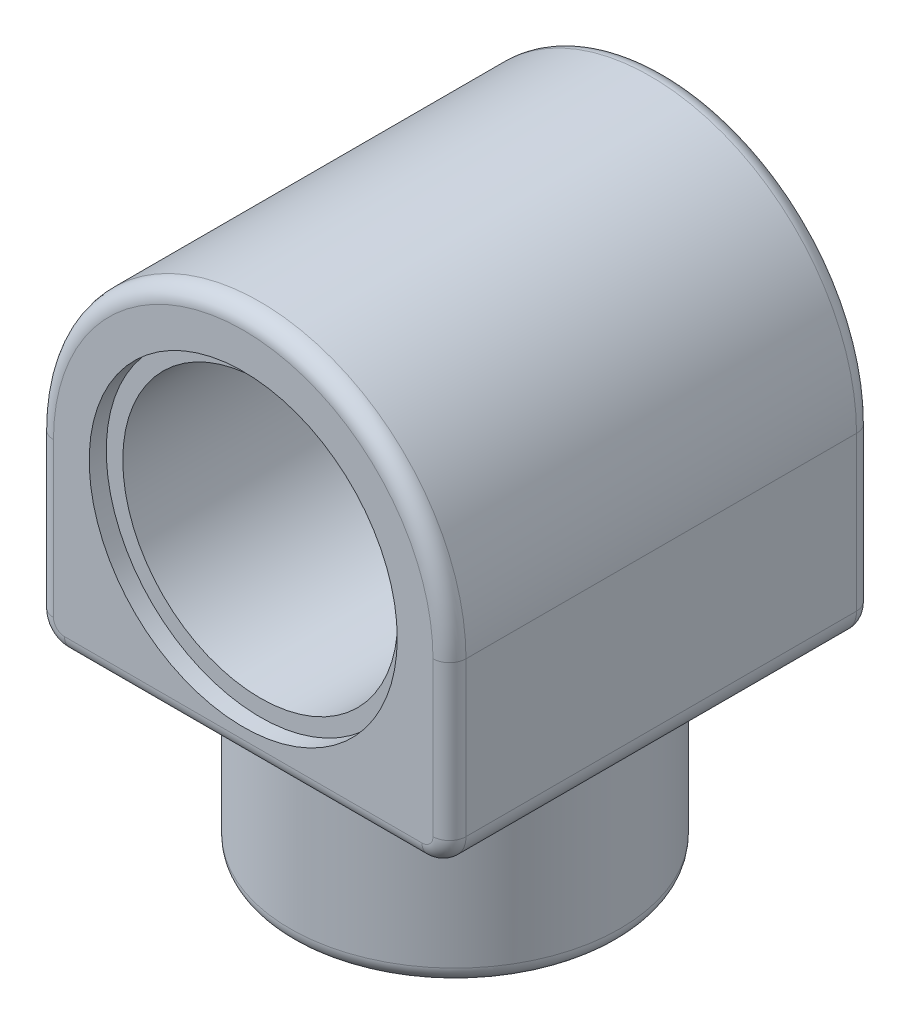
ISO-10303-21;
HEADER;
FILE_DESCRIPTION(('STEP AP214'),'2;1');
FILE_NAME('part.step','',(''),(''),'','','');
FILE_SCHEMA(('AUTOMOTIVE_DESIGN { 1 0 10303 214 1 1 1 1 }'));
ENDSEC;
DATA;
#1=APPLICATION_CONTEXT('core data for automotive mechanical design processes');
#2=APPLICATION_PROTOCOL_DEFINITION('international standard','automotive_design',2000,#1);
#3=PRODUCT_CONTEXT('',#1,'mechanical');
#4=PRODUCT('Part','Part','',(#3));
#5=PRODUCT_RELATED_PRODUCT_CATEGORY('part','',(#4));
#6=PRODUCT_DEFINITION_FORMATION('','',#4);
#7=PRODUCT_DEFINITION_CONTEXT('part definition',#1,'design');
#8=PRODUCT_DEFINITION('design','',#6,#7);
#9=PRODUCT_DEFINITION_SHAPE('','',#8);
#10=(LENGTH_UNIT() NAMED_UNIT(*) SI_UNIT(.MILLI.,.METRE.));
#11=(NAMED_UNIT(*) PLANE_ANGLE_UNIT() SI_UNIT($,.RADIAN.));
#12=(NAMED_UNIT(*) SI_UNIT($,.STERADIAN.) SOLID_ANGLE_UNIT());
#13=UNCERTAINTY_MEASURE_WITH_UNIT(LENGTH_MEASURE(1.E-05),#10,'distance_accuracy_value','');
#14=(GEOMETRIC_REPRESENTATION_CONTEXT(3) GLOBAL_UNCERTAINTY_ASSIGNED_CONTEXT((#13)) GLOBAL_UNIT_ASSIGNED_CONTEXT((#10,
#11,#12)) REPRESENTATION_CONTEXT('',''));
#15=CARTESIAN_POINT('',(0.,0.,0.));
#16=DIRECTION('',(0.,0.,1.));
#17=DIRECTION('',(1.,0.,0.));
#18=AXIS2_PLACEMENT_3D('',#15,#16,#17);
#19=CARTESIAN_POINT('',(0.,0.,-38.5));
#20=DIRECTION('',(0.,0.,1.));
#21=DIRECTION('',(1.,0.,0.));
#22=AXIS2_PLACEMENT_3D('',#19,#20,#21);
#23=PLANE('',#22);
#24=CARTESIAN_POINT('',(-18.1865334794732,10.5,-38.5));
#25=DIRECTION('',(0.,0.,-1.));
#26=DIRECTION('',(-1.,0.,0.));
#27=AXIS2_PLACEMENT_3D('',#24,#25,#26);
#28=CIRCLE('',#27,3.5);
#29=CARTESIAN_POINT('',(-21.6865334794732,10.5,-38.5));
#30=VERTEX_POINT('',#29);
#31=EDGE_CURVE('E582',#30,#30,#28,.T.);
#32=ORIENTED_EDGE('',*,*,#31,.F.);
#33=EDGE_LOOP('',(#32));
#34=FACE_BOUND('',#33,.T.);
#35=CARTESIAN_POINT('',(-32.5,-28.0000000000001,-38.5));
#36=DIRECTION('',(0.,0.,1.));
#37=DIRECTION('',(1.,0.,0.));
#38=AXIS2_PLACEMENT_3D('',#35,#36,#37);
#39=CIRCLE('',#38,2.);
#40=CARTESIAN_POINT('',(-32.5,-30.0000000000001,-38.5));
#41=VERTEX_POINT('',#40);
#42=CARTESIAN_POINT('',(-34.5,-28.0000000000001,-38.5));
#43=VERTEX_POINT('',#42);
#44=EDGE_CURVE('E41',#41,#43,#39,.F.);
#45=ORIENTED_EDGE('',*,*,#44,.T.);
#46=DIRECTION('',(0.,-1.,0.));
#47=VECTOR('',#46,1.);
#48=CARTESIAN_POINT('',(-34.5,0.,-38.5));
#49=LINE('',#48,#47);
#50=CARTESIAN_POINT('',(-34.5,0.,-38.5));
#51=VERTEX_POINT('',#50);
#52=EDGE_CURVE('E11',#43,#51,#49,.F.);
#53=ORIENTED_EDGE('',*,*,#52,.T.);
#54=CARTESIAN_POINT('',(0.,0.,-38.5));
#55=DIRECTION('',(0.,0.,1.));
#56=DIRECTION('',(1.,0.,0.));
#57=AXIS2_PLACEMENT_3D('',#54,#55,#56);
#58=CIRCLE('',#57,34.5);
#59=CARTESIAN_POINT('',(34.5,0.,-38.5));
#60=VERTEX_POINT('',#59);
#61=EDGE_CURVE('E469',#51,#60,#58,.F.);
#62=ORIENTED_EDGE('',*,*,#61,.T.);
#63=DIRECTION('',(0.,1.,0.));
#64=VECTOR('',#63,1.);
#65=CARTESIAN_POINT('',(34.5,0.,-38.5));
#66=LINE('',#65,#64);
#67=CARTESIAN_POINT('',(34.4999999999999,-28.0000000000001,-38.5));
#68=VERTEX_POINT('',#67);
#69=EDGE_CURVE('E404',#60,#68,#66,.F.);
#70=ORIENTED_EDGE('',*,*,#69,.T.);
#71=CARTESIAN_POINT('',(32.5,-28.0000000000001,-38.5));
#72=DIRECTION('',(0.,0.,1.));
#73=DIRECTION('',(1.,0.,0.));
#74=AXIS2_PLACEMENT_3D('',#71,#72,#73);
#75=CIRCLE('',#74,2.);
#76=CARTESIAN_POINT('',(32.4999999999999,-30.0000000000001,-38.5));
#77=VERTEX_POINT('',#76);
#78=EDGE_CURVE('E466',#68,#77,#75,.F.);
#79=ORIENTED_EDGE('',*,*,#78,.T.);
#80=DIRECTION('',(1.,0.,0.));
#81=VECTOR('',#80,1.);
#82=CARTESIAN_POINT('',(0.,-30.,-38.5));
#83=LINE('',#82,#81);
#84=EDGE_CURVE('E51',#77,#41,#83,.F.);
#85=ORIENTED_EDGE('',*,*,#84,.T.);
#86=EDGE_LOOP('',(#45,#53,#62,#70,#79,#85));
#87=FACE_BOUND('',#86,.T.);
#88=CARTESIAN_POINT('',(0.,0.,-38.5));
#89=DIRECTION('',(0.,0.,1.));
#90=DIRECTION('',(1.,0.,0.));
#91=AXIS2_PLACEMENT_3D('',#88,#89,#90);
#92=CIRCLE('',#91,13.5);
#93=CARTESIAN_POINT('',(13.5,0.,-38.5));
#94=VERTEX_POINT('',#93);
#95=EDGE_CURVE('E597',#94,#94,#92,.T.);
#96=ORIENTED_EDGE('',*,*,#95,.T.);
#97=EDGE_LOOP('',(#96));
#98=FACE_BOUND('',#97,.T.);
#99=CARTESIAN_POINT('',(0.,-21.,-38.5));
#100=DIRECTION('',(0.,0.,-1.));
#101=DIRECTION('',(-1.,0.,0.));
#102=AXIS2_PLACEMENT_3D('',#99,#100,#101);
#103=CIRCLE('',#102,3.5);
#104=CARTESIAN_POINT('',(-3.50000000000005,-21.,-38.5));
#105=VERTEX_POINT('',#104);
#106=EDGE_CURVE('E591',#105,#105,#103,.T.);
#107=ORIENTED_EDGE('',*,*,#106,.F.);
#108=EDGE_LOOP('',(#107));
#109=FACE_BOUND('',#108,.T.);
#110=CARTESIAN_POINT('',(18.1865334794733,10.4999999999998,-38.5));
#111=DIRECTION('',(0.,0.,-1.));
#112=DIRECTION('',(-1.,0.,0.));
#113=AXIS2_PLACEMENT_3D('',#110,#111,#112);
#114=CIRCLE('',#113,3.5);
#115=CARTESIAN_POINT('',(14.6865334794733,10.4999999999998,-38.5));
#116=VERTEX_POINT('',#115);
#117=EDGE_CURVE('E573',#116,#116,#114,.T.);
#118=ORIENTED_EDGE('',*,*,#117,.F.);
#119=EDGE_LOOP('',(#118));
#120=FACE_BOUND('',#119,.T.);
#121=ADVANCED_FACE('F32',(#34,#87,#98,#109,#120),#23,.F.);
#122=CARTESIAN_POINT('',(-32.5,-33.0000000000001,38.5));
#123=DIRECTION('',(0.,1.,0.));
#124=DIRECTION('',(0.,0.,1.));
#125=AXIS2_PLACEMENT_3D('',#122,#123,#124);
#126=PLANE('',#125);
#127=DIRECTION('',(0.,0.,-1.));
#128=VECTOR('',#127,1.);
#129=CARTESIAN_POINT('',(32.5,-33.0000000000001,38.5));
#130=LINE('',#129,#128);
#131=CARTESIAN_POINT('',(32.4999999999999,-33.0000000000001,35.5));
#132=VERTEX_POINT('',#131);
#133=CARTESIAN_POINT('',(32.5,-33.0000000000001,5.72276157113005));
#134=VERTEX_POINT('',#133);
#135=EDGE_CURVE('E351',#132,#134,#130,.T.);
#136=ORIENTED_EDGE('',*,*,#135,.F.);
#137=DIRECTION('',(1.,0.,0.));
#138=VECTOR('',#137,1.);
#139=CARTESIAN_POINT('',(0.,-33.0000000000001,35.5));
#140=LINE('',#139,#138);
#141=CARTESIAN_POINT('',(-32.5,-33.0000000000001,35.5));
#142=VERTEX_POINT('',#141);
#143=EDGE_CURVE('E382',#132,#142,#140,.F.);
#144=ORIENTED_EDGE('',*,*,#143,.T.);
#145=DIRECTION('',(0.,0.,-1.));
#146=VECTOR('',#145,1.);
#147=CARTESIAN_POINT('',(-32.5,-33.0000000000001,38.5));
#148=LINE('',#147,#146);
#149=CARTESIAN_POINT('',(-32.5,-33.0000000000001,5.72276157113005));
#150=VERTEX_POINT('',#149);
#151=EDGE_CURVE('E366',#142,#150,#148,.T.);
#152=ORIENTED_EDGE('',*,*,#151,.T.);
#153=CARTESIAN_POINT('',(0.,-33.0000000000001,0.));
#154=DIRECTION('',(0.,1.,0.));
#155=DIRECTION('',(0.,0.,1.));
#156=AXIS2_PLACEMENT_3D('',#153,#154,#155);
#157=CIRCLE('',#156,33.);
#158=EDGE_CURVE('E340',#150,#134,#157,.T.);
#159=ORIENTED_EDGE('',*,*,#158,.T.);
#160=EDGE_LOOP('',(#136,#144,#152,#159));
#161=FACE_BOUND('',#160,.T.);
#162=ADVANCED_FACE('F261',(#161),#126,.F.);
#163=CARTESIAN_POINT('',(32.5,-33.0000000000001,-5.72276157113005));
#164=VERTEX_POINT('',#163);
#165=CARTESIAN_POINT('',(32.5,-33.0000000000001,-35.5));
#166=VERTEX_POINT('',#165);
#167=EDGE_CURVE('E348',#164,#166,#130,.T.);
#168=ORIENTED_EDGE('',*,*,#167,.F.);
#169=CARTESIAN_POINT('',(0.,-33.0000000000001,0.));
#170=DIRECTION('',(0.,1.,0.));
#171=DIRECTION('',(0.,0.,1.));
#172=AXIS2_PLACEMENT_3D('',#169,#170,#171);
#173=CIRCLE('',#172,33.);
#174=CARTESIAN_POINT('',(-32.5,-33.0000000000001,-5.72276157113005));
#175=VERTEX_POINT('',#174);
#176=EDGE_CURVE('E332',#164,#175,#173,.T.);
#177=ORIENTED_EDGE('',*,*,#176,.T.);
#178=CARTESIAN_POINT('',(-32.5,-33.0000000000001,-35.5));
#179=VERTEX_POINT('',#178);
#180=EDGE_CURVE('E359',#175,#179,#148,.T.);
#181=ORIENTED_EDGE('',*,*,#180,.T.);
#182=DIRECTION('',(1.,0.,0.));
#183=VECTOR('',#182,1.);
#184=CARTESIAN_POINT('',(-32.5,-33.0000000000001,-35.5));
#185=LINE('',#184,#183);
#186=EDGE_CURVE('E356',#179,#166,#185,.T.);
#187=ORIENTED_EDGE('',*,*,#186,.T.);
#188=EDGE_LOOP('',(#168,#177,#181,#187));
#189=FACE_BOUND('',#188,.T.);
#190=ADVANCED_FACE('F203',(#189),#126,.F.);
#191=CARTESIAN_POINT('',(0.,0.,38.5));
#192=DIRECTION('',(0.,0.,-1.));
#193=DIRECTION('',(-1.,0.,0.));
#194=AXIS2_PLACEMENT_3D('',#191,#192,#193);
#195=CYLINDRICAL_SURFACE('',#194,37.5);
#196=DIRECTION('',(0.,0.,-1.));
#197=VECTOR('',#196,1.);
#198=CARTESIAN_POINT('',(-37.5000000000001,0.,38.5));
#199=LINE('',#198,#197);
#200=CARTESIAN_POINT('',(-37.5,0.,35.5));
#201=VERTEX_POINT('',#200);
#202=CARTESIAN_POINT('',(-37.5000000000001,0.,-35.5));
#203=VERTEX_POINT('',#202);
#204=EDGE_CURVE('E165',#201,#203,#199,.T.);
#205=ORIENTED_EDGE('',*,*,#204,.F.);
#206=CARTESIAN_POINT('',(0.,0.,35.5));
#207=DIRECTION('',(0.,0.,1.));
#208=DIRECTION('',(1.,0.,0.));
#209=AXIS2_PLACEMENT_3D('',#206,#207,#208);
#210=CIRCLE('',#209,37.5);
#211=CARTESIAN_POINT('',(37.5,0.,35.5));
#212=VERTEX_POINT('',#211);
#213=EDGE_CURVE('E399',#201,#212,#210,.F.);
#214=ORIENTED_EDGE('',*,*,#213,.T.);
#215=DIRECTION('',(0.,0.,-1.));
#216=VECTOR('',#215,1.);
#217=CARTESIAN_POINT('',(37.5,0.,38.5));
#218=LINE('',#217,#216);
#219=CARTESIAN_POINT('',(37.5,0.,-35.5));
#220=VERTEX_POINT('',#219);
#221=EDGE_CURVE('E361',#212,#220,#218,.T.);
#222=ORIENTED_EDGE('',*,*,#221,.T.);
#223=CARTESIAN_POINT('',(0.,0.,-35.5));
#224=DIRECTION('',(0.,0.,1.));
#225=DIRECTION('',(1.,0.,0.));
#226=AXIS2_PLACEMENT_3D('',#223,#224,#225);
#227=CIRCLE('',#226,37.5);
#228=EDGE_CURVE('E398',#220,#203,#227,.T.);
#229=ORIENTED_EDGE('',*,*,#228,.T.);
#230=EDGE_LOOP('',(#205,#214,#222,#229));
#231=FACE_BOUND('',#230,.T.);
#232=ADVANCED_FACE('F396',(#231),#195,.T.);
#233=CARTESIAN_POINT('',(-37.5000000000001,0.,38.5));
#234=DIRECTION('',(1.,0.,0.));
#235=DIRECTION('',(0.,1.,0.));
#236=AXIS2_PLACEMENT_3D('',#233,#234,#235);
#237=PLANE('',#236);
#238=DIRECTION('',(0.,0.,-1.));
#239=VECTOR('',#238,1.);
#240=CARTESIAN_POINT('',(-37.5,-28.,38.5));
#241=LINE('',#240,#239);
#242=CARTESIAN_POINT('',(-37.5,-28.,35.5));
#243=VERTEX_POINT('',#242);
#244=CARTESIAN_POINT('',(-37.5,-28.,-35.5));
#245=VERTEX_POINT('',#244);
#246=EDGE_CURVE('E367',#243,#245,#241,.T.);
#247=ORIENTED_EDGE('',*,*,#246,.F.);
#248=DIRECTION('',(0.,-1.,0.));
#249=VECTOR('',#248,1.);
#250=CARTESIAN_POINT('',(-37.5,0.,35.5));
#251=LINE('',#250,#249);
#252=EDGE_CURVE('E410',#243,#201,#251,.F.);
#253=ORIENTED_EDGE('',*,*,#252,.T.);
#254=ORIENTED_EDGE('',*,*,#204,.T.);
#255=DIRECTION('',(0.,-1.,0.));
#256=VECTOR('',#255,1.);
#257=CARTESIAN_POINT('',(-37.5000000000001,0.,-35.5));
#258=LINE('',#257,#256);
#259=EDGE_CURVE('E414',#203,#245,#258,.T.);
#260=ORIENTED_EDGE('',*,*,#259,.T.);
#261=EDGE_LOOP('',(#247,#253,#254,#260));
#262=FACE_BOUND('',#261,.T.);
#263=ADVANCED_FACE('F436',(#262),#237,.F.);
#264=CARTESIAN_POINT('',(-32.5,-28.0000000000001,38.5));
#265=DIRECTION('',(0.,0.,-1.));
#266=DIRECTION('',(-1.,0.,0.));
#267=AXIS2_PLACEMENT_3D('',#264,#265,#266);
#268=CYLINDRICAL_SURFACE('',#267,5.);
#269=ORIENTED_EDGE('',*,*,#151,.F.);
#270=CARTESIAN_POINT('',(-32.5,-28.0000000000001,35.5));
#271=DIRECTION('',(0.,0.,1.));
#272=DIRECTION('',(1.,0.,0.));
#273=AXIS2_PLACEMENT_3D('',#270,#271,#272);
#274=CIRCLE('',#273,5.);
#275=EDGE_CURVE('E445',#142,#243,#274,.F.);
#276=ORIENTED_EDGE('',*,*,#275,.T.);
#277=ORIENTED_EDGE('',*,*,#246,.T.);
#278=CARTESIAN_POINT('',(-32.5000000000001,-28.0000000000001,-35.5));
#279=DIRECTION('',(0.,0.,1.));
#280=DIRECTION('',(1.,0.,0.));
#281=AXIS2_PLACEMENT_3D('',#278,#279,#280);
#282=CIRCLE('',#281,5.);
#283=EDGE_CURVE('E446',#245,#179,#282,.T.);
#284=ORIENTED_EDGE('',*,*,#283,.T.);
#285=ORIENTED_EDGE('',*,*,#180,.F.);
#286=CARTESIAN_POINT('',(-31.0269999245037,-32.7781032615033,-13.4308414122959));
#287=CARTESIAN_POINT('',(-27.6032051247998,-31.7226112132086,-11.7603257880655));
#288=CARTESIAN_POINT('',(-27.4029089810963,-35.6449652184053,-12.2098558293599));
#289=CARTESIAN_POINT('',(-31.1121655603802,-32.8043348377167,-13.1250414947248));
#290=CARTESIAN_POINT('',(-27.7015173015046,-31.8191347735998,-11.5276477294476));
#291=CARTESIAN_POINT('',(-27.5267862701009,-35.6869357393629,-11.9318559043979));
#292=CARTESIAN_POINT('',(-31.1945679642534,-32.8272685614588,-12.816600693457));
#293=CARTESIAN_POINT('',(-27.8004997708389,-31.909480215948,-11.2855429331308));
#294=CARTESIAN_POINT('',(-27.6466443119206,-35.7236296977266,-11.6514551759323));
#295=CARTESIAN_POINT('',(-31.3536311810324,-32.867506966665,-12.1951081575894));
#296=CARTESIAN_POINT('',(-27.9956868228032,-32.0766671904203,-10.7894789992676));
#297=CARTESIAN_POINT('',(-27.8780089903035,-35.7880111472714,-11.0864619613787));
#298=CARTESIAN_POINT('',(-31.430293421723,-32.8848130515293,-11.8820575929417));
#299=CARTESIAN_POINT('',(-28.0920627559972,-32.1538529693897,-10.5354201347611));
#300=CARTESIAN_POINT('',(-27.9895177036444,-35.8157008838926,-10.8018705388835));
#301=CARTESIAN_POINT('',(-31.5776162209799,-32.9147571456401,-11.2522379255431));
#302=CARTESIAN_POINT('',(-28.2802828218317,-32.2959814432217,-10.0175468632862));
#303=CARTESIAN_POINT('',(-28.203805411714,-35.8636114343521,-10.2293072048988));
#304=CARTESIAN_POINT('',(-31.6482838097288,-32.9274006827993,-10.9354736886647));
#305=CARTESIAN_POINT('',(-28.3723196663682,-32.36121952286,-9.75357980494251));
#306=CARTESIAN_POINT('',(-28.3065946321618,-35.8838410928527,-9.94133971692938));
#307=CARTESIAN_POINT('',(-31.7835927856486,-32.9488834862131,-10.2983342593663));
#308=CARTESIAN_POINT('',(-28.5507615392,-32.4809598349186,-9.21717256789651));
#309=CARTESIAN_POINT('',(-28.5034076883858,-35.9182135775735,-9.3621220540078));
#310=CARTESIAN_POINT('',(-31.8482337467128,-32.9577224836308,-9.97795881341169));
#311=CARTESIAN_POINT('',(-28.6373598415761,-32.5356903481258,-8.94451139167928));
#312=CARTESIAN_POINT('',(-28.5974309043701,-35.932355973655,-9.0708716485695));
#313=CARTESIAN_POINT('',(-32.0330805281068,-32.9797052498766,-9.01142082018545));
#314=CARTESIAN_POINT('',(-28.8857564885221,-32.6848389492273,-8.12050905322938));
#315=CARTESIAN_POINT('',(-28.8662989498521,-35.9675284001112,-8.19220074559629));
#316=CARTESIAN_POINT('',(-32.1440754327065,-32.9882903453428,-8.36042277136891));
#317=CARTESIAN_POINT('',(-29.0402981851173,-32.7670838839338,-7.55145749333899));
#318=CARTESIAN_POINT('',(-29.0277460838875,-35.9812645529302,-7.60038433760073));
#319=CARTESIAN_POINT('',(-32.3409712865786,-32.9984420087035,-7.04838736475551));
#320=CARTESIAN_POINT('',(-29.3165684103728,-32.9024516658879,-6.39422530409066));
#321=CARTESIAN_POINT('',(-29.3141400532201,-35.9975072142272,-6.40762487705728));
#322=CARTESIAN_POINT('',(-32.4268599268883,-33.000005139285,-6.387345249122));
#323=CARTESIAN_POINT('',(-29.4396147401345,-32.9564688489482,-5.80350920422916));
#324=CARTESIAN_POINT('',(-29.4390689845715,-36.0000082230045,-5.80667749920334));
#325=CARTESIAN_POINT('',(-32.5519484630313,-32.9999963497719,-5.25073441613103));
#326=CARTESIAN_POINT('',(-29.61970694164,-33.0305394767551,-4.78087716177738));
#327=CARTESIAN_POINT('',(-29.6210159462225,-35.9999941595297,-4.77339492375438));
#328=CARTESIAN_POINT('',(-32.5974656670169,-32.9992015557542,-4.77692065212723));
#329=CARTESIAN_POINT('',(-29.6857316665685,-33.0560182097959,-4.35285018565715));
#330=CARTESIAN_POINT('',(-29.6872227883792,-35.9987224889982,-4.34265513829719));
#331=CARTESIAN_POINT('',(-32.6755619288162,-32.9970705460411,-3.82653372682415));
#332=CARTESIAN_POINT('',(-29.7991677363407,-33.0981729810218,-3.4923513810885));
#333=CARTESIAN_POINT('',(-29.8008173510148,-35.9953128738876,-3.47866702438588));
#334=CARTESIAN_POINT('',(-32.708140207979,-32.9957342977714,-3.34996040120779));
#335=CARTESIAN_POINT('',(-29.8468599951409,-33.1149675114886,-3.05883763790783));
#336=CARTESIAN_POINT('',(-29.8482039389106,-35.9931748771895,-3.0454185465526));
#337=CARTESIAN_POINT('',(-32.7602942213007,-32.9932881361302,-2.39494132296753));
#338=CARTESIAN_POINT('',(-29.9231821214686,-33.1412057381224,-2.18926831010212));
#339=CARTESIAN_POINT('',(-29.9240643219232,-35.9892610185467,-2.17721938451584));
#340=CARTESIAN_POINT('',(-32.7798684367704,-32.992178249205,-1.91649535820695));
#341=CARTESIAN_POINT('',(-29.9520002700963,-33.1507180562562,-1.75214046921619));
#342=CARTESIAN_POINT('',(-29.9525359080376,-35.9874851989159,-1.74226850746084));
#343=CARTESIAN_POINT('',(-32.8059711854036,-32.9906465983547,-0.958699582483));
#344=CARTESIAN_POINT('',(-29.9903610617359,-33.1632744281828,-0.87721851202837));
#345=CARTESIAN_POINT('',(-29.9905035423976,-35.9850345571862,-0.871545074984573));
#346=CARTESIAN_POINT('',(-32.8125,-32.9902248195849,-0.479349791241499));
#347=CARTESIAN_POINT('',(-30.,-33.1663504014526,-0.438335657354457));
#348=CARTESIAN_POINT('',(-30.,-35.9843597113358,-0.435772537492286));
#349=CARTESIAN_POINT('',(-32.8125,-32.9902248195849,0.479349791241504));
#350=CARTESIAN_POINT('',(-30.,-33.1663504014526,0.438335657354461));
#351=CARTESIAN_POINT('',(-30.,-35.9843597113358,0.43577253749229));
#352=CARTESIAN_POINT('',(-32.8059711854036,-32.9906465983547,0.958699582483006));
#353=CARTESIAN_POINT('',(-29.9903610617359,-33.1632744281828,0.877218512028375));
#354=CARTESIAN_POINT('',(-29.9905035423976,-35.9850345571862,0.871545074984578));
#355=CARTESIAN_POINT('',(-32.7798684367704,-32.992178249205,1.91649535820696));
#356=CARTESIAN_POINT('',(-29.9520002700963,-33.1507180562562,1.7521404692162));
#357=CARTESIAN_POINT('',(-29.9525359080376,-35.9874851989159,1.74226850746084));
#358=CARTESIAN_POINT('',(-32.7602942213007,-32.9932881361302,2.39494132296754));
#359=CARTESIAN_POINT('',(-29.9231821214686,-33.1412057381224,2.18926831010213));
#360=CARTESIAN_POINT('',(-29.9240643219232,-35.9892610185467,2.17721938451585));
#361=CARTESIAN_POINT('',(-32.708140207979,-32.9957342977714,3.3499604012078));
#362=CARTESIAN_POINT('',(-29.8468599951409,-33.1149675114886,3.05883763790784));
#363=CARTESIAN_POINT('',(-29.8482039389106,-35.9931748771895,3.0454185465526));
#364=CARTESIAN_POINT('',(-32.6755619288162,-32.9970705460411,3.82653372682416));
#365=CARTESIAN_POINT('',(-29.7991677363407,-33.0981729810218,3.49235138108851));
#366=CARTESIAN_POINT('',(-29.8008173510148,-35.9953128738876,3.47866702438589));
#367=CARTESIAN_POINT('',(-32.5974656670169,-32.9992015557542,4.77692065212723));
#368=CARTESIAN_POINT('',(-29.6857316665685,-33.0560182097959,4.35285018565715));
#369=CARTESIAN_POINT('',(-29.6872227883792,-35.9987224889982,4.3426551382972));
#370=CARTESIAN_POINT('',(-32.5519484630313,-32.9999963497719,5.25073441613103));
#371=CARTESIAN_POINT('',(-29.61970694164,-33.0305394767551,4.78087716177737));
#372=CARTESIAN_POINT('',(-29.6210159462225,-35.9999941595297,4.77339492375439));
#373=CARTESIAN_POINT('',(-32.4268599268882,-33.000005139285,6.38734524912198));
#374=CARTESIAN_POINT('',(-29.4396147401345,-32.9564688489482,5.80350920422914));
#375=CARTESIAN_POINT('',(-29.4390689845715,-36.0000082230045,5.80667749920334));
#376=CARTESIAN_POINT('',(-32.3409712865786,-32.9984420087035,7.04838736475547));
#377=CARTESIAN_POINT('',(-29.3165684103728,-32.9024516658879,6.39422530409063));
#378=CARTESIAN_POINT('',(-29.3141400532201,-35.9975072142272,6.40762487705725));
#379=CARTESIAN_POINT('',(-32.1440754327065,-32.9882903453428,8.36042277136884));
#380=CARTESIAN_POINT('',(-29.0402981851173,-32.7670838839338,7.55145749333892));
#381=CARTESIAN_POINT('',(-29.0277460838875,-35.9812645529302,7.60038433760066));
#382=CARTESIAN_POINT('',(-32.0330805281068,-32.9797052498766,9.01142082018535));
#383=CARTESIAN_POINT('',(-28.8857564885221,-32.6848389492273,8.12050905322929));
#384=CARTESIAN_POINT('',(-28.8662989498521,-35.9675284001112,8.19220074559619));
#385=CARTESIAN_POINT('',(-31.8482337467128,-32.9577224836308,9.97795881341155));
#386=CARTESIAN_POINT('',(-28.6373598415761,-32.5356903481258,8.94451139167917));
#387=CARTESIAN_POINT('',(-28.5974309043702,-35.932355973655,9.07087164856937));
#388=CARTESIAN_POINT('',(-31.7835927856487,-32.9488834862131,10.2983342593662));
#389=CARTESIAN_POINT('',(-28.5507615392,-32.4809598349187,9.21717256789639));
#390=CARTESIAN_POINT('',(-28.5034076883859,-35.9182135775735,9.36212205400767));
#391=CARTESIAN_POINT('',(-31.6482838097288,-32.9274006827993,10.9354736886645));
#392=CARTESIAN_POINT('',(-28.3723196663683,-32.36121952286,9.75357980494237));
#393=CARTESIAN_POINT('',(-28.3065946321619,-35.8838410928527,9.94133971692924));
#394=CARTESIAN_POINT('',(-31.57761622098,-32.9147571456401,11.2522379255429));
#395=CARTESIAN_POINT('',(-28.2802828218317,-32.2959814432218,10.0175468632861));
#396=CARTESIAN_POINT('',(-28.2038054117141,-35.8636114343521,10.2293072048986));
#397=CARTESIAN_POINT('',(-31.4302934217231,-32.8848130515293,11.8820575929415));
#398=CARTESIAN_POINT('',(-28.0920627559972,-32.1538529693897,10.5354201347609));
#399=CARTESIAN_POINT('',(-27.9895177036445,-35.8157008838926,10.8018705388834));
#400=CARTESIAN_POINT('',(-31.3536311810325,-32.867506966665,12.1951081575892));
#401=CARTESIAN_POINT('',(-27.9956868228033,-32.0766671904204,10.7894789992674));
#402=CARTESIAN_POINT('',(-27.8780089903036,-35.7880111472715,11.0864619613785));
#403=CARTESIAN_POINT('',(-31.1945679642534,-32.8272685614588,12.8166006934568));
#404=CARTESIAN_POINT('',(-27.800499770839,-31.909480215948,11.2855429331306));
#405=CARTESIAN_POINT('',(-27.6466443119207,-35.7236296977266,11.6514551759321));
#406=CARTESIAN_POINT('',(-31.1121655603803,-32.8043348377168,13.1250414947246));
#407=CARTESIAN_POINT('',(-27.7015173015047,-31.8191347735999,11.5276477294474));
#408=CARTESIAN_POINT('',(-27.526786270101,-35.6869357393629,11.9318559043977));
#409=CARTESIAN_POINT('',(-31.0269999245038,-32.7781032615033,13.4308414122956));
#410=CARTESIAN_POINT('',(-27.6032051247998,-31.7226112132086,11.7603257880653));
#411=CARTESIAN_POINT('',(-27.4029089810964,-35.6449652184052,12.2098558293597));
#412=(BOUNDED_SURFACE() B_SPLINE_SURFACE(3,2,((#286,#287,#288),(#289,#290,#291),(#292,#293,
#294),(#295,#296,#297),(#298,#299,#300),(#301,#302,#303),(#304,#305,#306),(#307,#308,#309),
(#310,#311,#312),(#313,#314,#315),(#316,#317,#318),(#319,#320,#321),(#322,#323,#324),(#325,#326,
#327),(#328,#329,#330),(#331,#332,#333),(#334,#335,#336),(#337,#338,#339),(#340,#341,#342),
(#343,#344,#345),(#346,#347,#348),(#349,#350,#351),(#352,#353,#354),(#355,#356,#357),(#358,#359,
#360),(#361,#362,#363),(#364,#365,#366),(#367,#368,#369),(#370,#371,#372),(#373,#374,#375),
(#376,#377,#378),(#379,#380,#381),(#382,#383,#384),(#385,#386,#387),(#388,#389,#390),(#391,#392,
#393),(#394,#395,#396),(#397,#398,#399),(#400,#401,#402),(#403,#404,#405),(#406,#407,#408),
(#409,#410,#411)),.UNSPECIFIED.,.F.,.F.,.F.) B_SPLINE_SURFACE_WITH_KNOTS((4,2,2,2,2,2,2,2,2,2,2,
2,2,2,2,2,2,2,2,2,4),(3,3),(0.,1.01206920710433,2.0238858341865,3.03449896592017,4.045183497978,
6.0683979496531,8.09260267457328,9.53031417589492,10.9681121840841,12.4060780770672,
13.8440129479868,15.2819478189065,16.7199137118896,18.1577117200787,19.5954232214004,
21.6196279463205,23.6428423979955,24.6535269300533,25.6641400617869,26.6759566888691,
27.6880258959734),(0.,1.),
.UNSPECIFIED.) GEOMETRIC_REPRESENTATION_ITEM() RATIONAL_B_SPLINE_SURFACE(((1.,0.604526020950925,
1.),(1.,0.610457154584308,1.),(1.,0.61619582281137,1.),(1.,0.627273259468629,1.),(1.,
0.632612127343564,1.),(1.,0.642871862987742,1.),(1.,0.647793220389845,1.),(1.,0.657216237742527,
1.),(1.,0.661717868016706,1.),(1.,0.674590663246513,1.),(1.,0.682320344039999,1.),(1.,
0.696032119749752,1.),(1.,0.702013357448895,1.),(1.,0.710724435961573,1.),(1.,0.713894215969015,
1.),(1.,0.719332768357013,1.),(1.,0.721601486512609,1.),(1.,0.725233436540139,1.),(1.,
0.72659656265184,1.),(1.,0.728414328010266,1.),(1.,0.728868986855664,1.),(1.,0.728868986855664,
1.),(1.,0.728414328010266,1.),(1.,0.72659656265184,1.),(1.,0.725233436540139,1.),(1.,
0.721601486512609,1.),(1.,0.719332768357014,1.),(1.,0.713894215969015,1.),(1.,0.710724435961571,
1.),(1.,0.702013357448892,1.),(1.,0.696032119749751,1.),(1.,0.68232034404,1.),(1.,
0.674590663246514,1.),(1.,0.661717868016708,1.),(1.,0.65721623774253,1.),(1.,0.647793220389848,
1.),(1.,0.642871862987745,1.),(1.,0.632612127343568,1.),(1.,0.627273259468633,1.),(1.,
0.616195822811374,1.),(1.,0.610457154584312,1.),(1.,0.604526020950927,1.))) REPRESENTATION_ITEM('') SURFACE());
#413=CARTESIAN_POINT('',(-31.0269999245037,-32.7781032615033,-13.4308414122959));
#414=CARTESIAN_POINT('',(-31.1121655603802,-32.8043348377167,-13.1250414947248));
#415=CARTESIAN_POINT('',(-31.1945679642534,-32.8272685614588,-12.816600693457));
#416=CARTESIAN_POINT('',(-31.3536311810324,-32.867506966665,-12.1951081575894));
#417=CARTESIAN_POINT('',(-31.430293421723,-32.8848130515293,-11.8820575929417));
#418=CARTESIAN_POINT('',(-31.5776162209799,-32.9147571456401,-11.2522379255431));
#419=CARTESIAN_POINT('',(-31.6482838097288,-32.9274006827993,-10.9354736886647));
#420=CARTESIAN_POINT('',(-31.7835927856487,-32.9488834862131,-10.2983342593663));
#421=CARTESIAN_POINT('',(-31.8482337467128,-32.9577224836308,-9.97795881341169));
#422=CARTESIAN_POINT('',(-32.0330805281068,-32.9797052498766,-9.01142082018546));
#423=CARTESIAN_POINT('',(-32.1440754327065,-32.9882903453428,-8.36042277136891));
#424=CARTESIAN_POINT('',(-32.3409712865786,-32.9984420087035,-7.0483873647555));
#425=CARTESIAN_POINT('',(-32.4268599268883,-33.000005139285,-6.387345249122));
#426=CARTESIAN_POINT('',(-32.5519484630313,-32.9999963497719,-5.25073441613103));
#427=CARTESIAN_POINT('',(-32.5974656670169,-32.9992015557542,-4.77692065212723));
#428=CARTESIAN_POINT('',(-32.6755619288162,-32.9970705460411,-3.82653372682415));
#429=CARTESIAN_POINT('',(-32.708140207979,-32.9957342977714,-3.34996040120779));
#430=CARTESIAN_POINT('',(-32.7602942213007,-32.9932881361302,-2.39494132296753));
#431=CARTESIAN_POINT('',(-32.7798684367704,-32.992178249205,-1.91649535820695));
#432=CARTESIAN_POINT('',(-32.8059711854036,-32.9906465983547,-0.958699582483));
#433=CARTESIAN_POINT('',(-32.8125,-32.9902248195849,-0.479349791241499));
#434=CARTESIAN_POINT('',(-32.8125,-32.9902248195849,0.479349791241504));
#435=CARTESIAN_POINT('',(-32.8059711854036,-32.9906465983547,0.958699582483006));
#436=CARTESIAN_POINT('',(-32.7798684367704,-32.992178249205,1.91649535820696));
#437=CARTESIAN_POINT('',(-32.7602942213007,-32.9932881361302,2.39494132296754));
#438=CARTESIAN_POINT('',(-32.708140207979,-32.9957342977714,3.3499604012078));
#439=CARTESIAN_POINT('',(-32.6755619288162,-32.9970705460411,3.82653372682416));
#440=CARTESIAN_POINT('',(-32.5974656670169,-32.9992015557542,4.77692065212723));
#441=CARTESIAN_POINT('',(-32.5519484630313,-32.9999963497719,5.25073441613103));
#442=CARTESIAN_POINT('',(-32.4268599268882,-33.000005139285,6.38734524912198));
#443=CARTESIAN_POINT('',(-32.3409712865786,-32.9984420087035,7.04838736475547));
#444=CARTESIAN_POINT('',(-32.1440754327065,-32.9882903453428,8.36042277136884));
#445=CARTESIAN_POINT('',(-32.0330805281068,-32.9797052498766,9.01142082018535));
#446=CARTESIAN_POINT('',(-31.8482337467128,-32.9577224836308,9.97795881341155));
#447=CARTESIAN_POINT('',(-31.7835927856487,-32.9488834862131,10.2983342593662));
#448=CARTESIAN_POINT('',(-31.6482838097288,-32.9274006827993,10.9354736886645));
#449=CARTESIAN_POINT('',(-31.57761622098,-32.9147571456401,11.2522379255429));
#450=CARTESIAN_POINT('',(-31.4302934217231,-32.8848130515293,11.8820575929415));
#451=CARTESIAN_POINT('',(-31.3536311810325,-32.867506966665,12.1951081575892));
#452=CARTESIAN_POINT('',(-31.1945679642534,-32.8272685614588,12.8166006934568));
#453=CARTESIAN_POINT('',(-31.1121655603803,-32.8043348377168,13.1250414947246));
#454=CARTESIAN_POINT('',(-31.0269999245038,-32.7781032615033,13.4308414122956));
#455=B_SPLINE_CURVE_WITH_KNOTS('',3,(#413,#414,#415,#416,#417,#418,#419,#420,#421,#422,#423,
#424,#425,#426,#427,#428,#429,#430,#431,#432,#433,#434,#435,#436,#437,#438,#439,#440,#441,#442,
#443,#444,#445,#446,#447,#448,#449,#450,#451,#452,#453,#454),.UNSPECIFIED.,.F.,.F.,(4,2,2,2,2,2,
2,2,2,2,2,2,2,2,2,2,2,2,2,2,4),(0.,1.01206920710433,2.0238858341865,3.03449896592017,
4.045183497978,6.0683979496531,8.09260267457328,9.53031417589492,10.9681121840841,
12.4060780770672,13.8440129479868,15.2819478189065,16.7199137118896,18.1577117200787,
19.5954232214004,21.6196279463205,23.6428423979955,24.6535269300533,25.6641400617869,
26.6759566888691,27.6880258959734),.UNSPECIFIED.);
#456=EDGE_CURVE('E439',#175,#150,#455,.T.);
#457=ORIENTED_EDGE('',*,*,#456,.T.);
#458=EDGE_LOOP('',(#269,#276,#277,#284,#285,#457));
#459=FACE_BOUND('',#458,.T.);
#460=ADVANCED_FACE('F200',(#459),#268,.T.);
#461=CARTESIAN_POINT('',(32.5,-28.0000000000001,38.5));
#462=DIRECTION('',(0.,0.,-1.));
#463=DIRECTION('',(-1.,0.,0.));
#464=AXIS2_PLACEMENT_3D('',#461,#462,#463);
#465=CYLINDRICAL_SURFACE('',#464,5.);
#466=DIRECTION('',(0.,0.,-1.));
#467=VECTOR('',#466,1.);
#468=CARTESIAN_POINT('',(37.5,-28.0000000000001,38.5));
#469=LINE('',#468,#467);
#470=CARTESIAN_POINT('',(37.4999999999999,-28.0000000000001,35.5));
#471=VERTEX_POINT('',#470);
#472=CARTESIAN_POINT('',(37.4999999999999,-28.0000000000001,-35.5));
#473=VERTEX_POINT('',#472);
#474=EDGE_CURVE('E357',#471,#473,#469,.T.);
#475=ORIENTED_EDGE('',*,*,#474,.F.);
#476=CARTESIAN_POINT('',(32.5,-28.0000000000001,35.5));
#477=DIRECTION('',(0.,0.,1.));
#478=DIRECTION('',(1.,0.,0.));
#479=AXIS2_PLACEMENT_3D('',#476,#477,#478);
#480=CIRCLE('',#479,5.);
#481=EDGE_CURVE('E188',#471,#132,#480,.F.);
#482=ORIENTED_EDGE('',*,*,#481,.T.);
#483=ORIENTED_EDGE('',*,*,#135,.T.);
#484=CARTESIAN_POINT('',(31.0269999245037,-32.7781032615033,13.4308414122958));
#485=CARTESIAN_POINT('',(27.6032051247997,-31.7226112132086,11.7603257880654));
#486=CARTESIAN_POINT('',(27.4029089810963,-35.6449652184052,12.2098558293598));
#487=CARTESIAN_POINT('',(31.1121655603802,-32.8043348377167,13.1250414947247));
#488=CARTESIAN_POINT('',(27.7015173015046,-31.8191347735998,11.5276477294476));
#489=CARTESIAN_POINT('',(27.5267862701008,-35.6869357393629,11.9318559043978));
#490=CARTESIAN_POINT('',(31.1945679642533,-32.8272685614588,12.8166006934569));
#491=CARTESIAN_POINT('',(27.8004997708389,-31.9094802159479,11.2855429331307));
#492=CARTESIAN_POINT('',(27.6466443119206,-35.7236296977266,11.6514551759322));
#493=CARTESIAN_POINT('',(31.3536311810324,-32.867506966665,12.1951081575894));
#494=CARTESIAN_POINT('',(27.9956868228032,-32.0766671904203,10.7894789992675));
#495=CARTESIAN_POINT('',(27.8780089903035,-35.7880111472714,11.0864619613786));
#496=CARTESIAN_POINT('',(31.430293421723,-32.8848130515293,11.8820575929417));
#497=CARTESIAN_POINT('',(28.0920627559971,-32.1538529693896,10.535420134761));
#498=CARTESIAN_POINT('',(27.9895177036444,-35.8157008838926,10.8018705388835));
#499=CARTESIAN_POINT('',(31.5776162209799,-32.9147571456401,11.2522379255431));
#500=CARTESIAN_POINT('',(28.2802828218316,-32.2959814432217,10.0175468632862));
#501=CARTESIAN_POINT('',(28.203805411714,-35.8636114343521,10.2293072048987));
#502=CARTESIAN_POINT('',(31.6482838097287,-32.9274006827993,10.9354736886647));
#503=CARTESIAN_POINT('',(28.3723196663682,-32.36121952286,9.75357980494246));
#504=CARTESIAN_POINT('',(28.3065946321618,-35.8838410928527,9.94133971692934));
#505=CARTESIAN_POINT('',(31.7835927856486,-32.9488834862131,10.2983342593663));
#506=CARTESIAN_POINT('',(28.5507615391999,-32.4809598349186,9.21717256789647));
#507=CARTESIAN_POINT('',(28.5034076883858,-35.9182135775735,9.36212205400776));
#508=CARTESIAN_POINT('',(31.8482337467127,-32.9577224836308,9.97795881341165));
#509=CARTESIAN_POINT('',(28.637359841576,-32.5356903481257,8.94451139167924));
#510=CARTESIAN_POINT('',(28.5974309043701,-35.932355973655,9.07087164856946));
#511=CARTESIAN_POINT('',(32.0330805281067,-32.9797052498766,9.01142082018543));
#512=CARTESIAN_POINT('',(28.885756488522,-32.6848389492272,8.12050905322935));
#513=CARTESIAN_POINT('',(28.866298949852,-35.9675284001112,8.19220074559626));
#514=CARTESIAN_POINT('',(32.1440754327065,-32.9882903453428,8.36042277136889));
#515=CARTESIAN_POINT('',(29.0402981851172,-32.7670838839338,7.55145749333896));
#516=CARTESIAN_POINT('',(29.0277460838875,-35.9812645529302,7.60038433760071));
#517=CARTESIAN_POINT('',(32.3409712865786,-32.9984420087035,7.0483873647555));
#518=CARTESIAN_POINT('',(29.3165684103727,-32.9024516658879,6.39422530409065));
#519=CARTESIAN_POINT('',(29.3141400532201,-35.9975072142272,6.40762487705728));
#520=CARTESIAN_POINT('',(32.4268599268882,-33.000005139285,6.38734524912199));
#521=CARTESIAN_POINT('',(29.4396147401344,-32.9564688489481,5.80350920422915));
#522=CARTESIAN_POINT('',(29.4390689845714,-36.0000082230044,5.80667749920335));
#523=CARTESIAN_POINT('',(32.5519484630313,-32.9999963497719,5.25073441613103));
#524=CARTESIAN_POINT('',(29.6197069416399,-33.030539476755,4.78087716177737));
#525=CARTESIAN_POINT('',(29.6210159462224,-35.9999941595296,4.77339492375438));
#526=CARTESIAN_POINT('',(32.5974656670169,-32.9992015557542,4.77692065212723));
#527=CARTESIAN_POINT('',(29.6857316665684,-33.0560182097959,4.35285018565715));
#528=CARTESIAN_POINT('',(29.6872227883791,-35.9987224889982,4.34265513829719));
#529=CARTESIAN_POINT('',(32.6755619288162,-32.9970705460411,3.82653372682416));
#530=CARTESIAN_POINT('',(29.7991677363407,-33.0981729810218,3.4923513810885));
#531=CARTESIAN_POINT('',(29.8008173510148,-35.9953128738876,3.47866702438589));
#532=CARTESIAN_POINT('',(32.708140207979,-32.9957342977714,3.34996040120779));
#533=CARTESIAN_POINT('',(29.8468599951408,-33.1149675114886,3.05883763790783));
#534=CARTESIAN_POINT('',(29.8482039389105,-35.9931748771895,3.0454185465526));
#535=CARTESIAN_POINT('',(32.7602942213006,-32.9932881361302,2.39494132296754));
#536=CARTESIAN_POINT('',(29.9231821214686,-33.1412057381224,2.18926831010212));
#537=CARTESIAN_POINT('',(29.9240643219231,-35.9892610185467,2.17721938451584));
#538=CARTESIAN_POINT('',(32.7798684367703,-32.992178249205,1.91649535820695));
#539=CARTESIAN_POINT('',(29.9520002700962,-33.1507180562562,1.75214046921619));
#540=CARTESIAN_POINT('',(29.9525359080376,-35.9874851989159,1.74226850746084));
#541=CARTESIAN_POINT('',(32.8059711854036,-32.9906465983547,0.958699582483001));
#542=CARTESIAN_POINT('',(29.9903610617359,-33.1632744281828,0.87721851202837));
#543=CARTESIAN_POINT('',(29.9905035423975,-35.9850345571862,0.871545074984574));
#544=CARTESIAN_POINT('',(32.8125,-32.9902248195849,0.479349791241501));
#545=CARTESIAN_POINT('',(30.,-33.1663504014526,0.438335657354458));
#546=CARTESIAN_POINT('',(30.,-35.9843597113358,0.435772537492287));
#547=CARTESIAN_POINT('',(32.8125,-32.9902248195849,-0.479349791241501));
#548=CARTESIAN_POINT('',(30.,-33.1663504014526,-0.438335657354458));
#549=CARTESIAN_POINT('',(30.,-35.9843597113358,-0.435772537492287));
#550=CARTESIAN_POINT('',(32.8059711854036,-32.9906465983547,-0.958699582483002));
#551=CARTESIAN_POINT('',(29.9903610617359,-33.1632744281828,-0.877218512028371));
#552=CARTESIAN_POINT('',(29.9905035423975,-35.9850345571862,-0.871545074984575));
#553=CARTESIAN_POINT('',(32.7798684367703,-32.992178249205,-1.91649535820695));
#554=CARTESIAN_POINT('',(29.9520002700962,-33.1507180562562,-1.75214046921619));
#555=CARTESIAN_POINT('',(29.9525359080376,-35.9874851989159,-1.74226850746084));
#556=CARTESIAN_POINT('',(32.7602942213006,-32.9932881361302,-2.39494132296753));
#557=CARTESIAN_POINT('',(29.9231821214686,-33.1412057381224,-2.18926831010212));
#558=CARTESIAN_POINT('',(29.9240643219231,-35.9892610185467,-2.17721938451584));
#559=CARTESIAN_POINT('',(32.708140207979,-32.9957342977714,-3.34996040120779));
#560=CARTESIAN_POINT('',(29.8468599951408,-33.1149675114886,-3.05883763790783));
#561=CARTESIAN_POINT('',(29.8482039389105,-35.9931748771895,-3.0454185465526));
#562=CARTESIAN_POINT('',(32.6755619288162,-32.9970705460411,-3.82653372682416));
#563=CARTESIAN_POINT('',(29.7991677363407,-33.0981729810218,-3.4923513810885));
#564=CARTESIAN_POINT('',(29.8008173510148,-35.9953128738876,-3.47866702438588));
#565=CARTESIAN_POINT('',(32.5974656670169,-32.9992015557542,-4.77692065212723));
#566=CARTESIAN_POINT('',(29.6857316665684,-33.0560182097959,-4.35285018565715));
#567=CARTESIAN_POINT('',(29.6872227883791,-35.9987224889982,-4.34265513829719));
#568=CARTESIAN_POINT('',(32.5519484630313,-32.9999963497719,-5.25073441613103));
#569=CARTESIAN_POINT('',(29.6197069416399,-33.030539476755,-4.78087716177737));
#570=CARTESIAN_POINT('',(29.6210159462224,-35.9999941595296,-4.77339492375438));
#571=CARTESIAN_POINT('',(32.4268599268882,-33.000005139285,-6.38734524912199));
#572=CARTESIAN_POINT('',(29.4396147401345,-32.9564688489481,-5.80350920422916));
#573=CARTESIAN_POINT('',(29.4390689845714,-36.0000082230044,-5.80667749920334));
#574=CARTESIAN_POINT('',(32.3409712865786,-32.9984420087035,-7.04838736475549));
#575=CARTESIAN_POINT('',(29.3165684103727,-32.9024516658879,-6.39422530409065));
#576=CARTESIAN_POINT('',(29.3141400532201,-35.9975072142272,-6.40762487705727));
#577=CARTESIAN_POINT('',(32.1440754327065,-32.9882903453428,-8.36042277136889));
#578=CARTESIAN_POINT('',(29.0402981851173,-32.7670838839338,-7.55145749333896));
#579=CARTESIAN_POINT('',(29.0277460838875,-35.9812645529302,-7.6003843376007));
#580=CARTESIAN_POINT('',(32.0330805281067,-32.9797052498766,-9.01142082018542));
#581=CARTESIAN_POINT('',(28.885756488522,-32.6848389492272,-8.12050905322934));
#582=CARTESIAN_POINT('',(28.866298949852,-35.9675284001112,-8.19220074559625));
#583=CARTESIAN_POINT('',(31.8482337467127,-32.9577224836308,-9.97795881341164));
#584=CARTESIAN_POINT('',(28.637359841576,-32.5356903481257,-8.94451139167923));
#585=CARTESIAN_POINT('',(28.5974309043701,-35.932355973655,-9.07087164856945));
#586=CARTESIAN_POINT('',(31.7835927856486,-32.9488834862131,-10.2983342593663));
#587=CARTESIAN_POINT('',(28.5507615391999,-32.4809598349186,-9.21717256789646));
#588=CARTESIAN_POINT('',(28.5034076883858,-35.9182135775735,-9.36212205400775));
#589=CARTESIAN_POINT('',(31.6482838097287,-32.9274006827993,-10.9354736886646));
#590=CARTESIAN_POINT('',(28.3723196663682,-32.36121952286,-9.75357980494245));
#591=CARTESIAN_POINT('',(28.3065946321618,-35.8838410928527,-9.94133971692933));
#592=CARTESIAN_POINT('',(31.5776162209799,-32.9147571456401,-11.252237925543));
#593=CARTESIAN_POINT('',(28.2802828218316,-32.2959814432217,-10.0175468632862));
#594=CARTESIAN_POINT('',(28.203805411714,-35.8636114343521,-10.2293072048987));
#595=CARTESIAN_POINT('',(31.430293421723,-32.8848130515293,-11.8820575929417));
#596=CARTESIAN_POINT('',(28.0920627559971,-32.1538529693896,-10.535420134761));
#597=CARTESIAN_POINT('',(27.9895177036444,-35.8157008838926,-10.8018705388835));
#598=CARTESIAN_POINT('',(31.3536311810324,-32.867506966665,-12.1951081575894));
#599=CARTESIAN_POINT('',(27.9956868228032,-32.0766671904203,-10.7894789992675));
#600=CARTESIAN_POINT('',(27.8780089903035,-35.7880111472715,-11.0864619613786));
#601=CARTESIAN_POINT('',(31.1945679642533,-32.8272685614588,-12.8166006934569));
#602=CARTESIAN_POINT('',(27.8004997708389,-31.9094802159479,-11.2855429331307));
#603=CARTESIAN_POINT('',(27.6466443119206,-35.7236296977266,-11.6514551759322));
#604=CARTESIAN_POINT('',(31.1121655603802,-32.8043348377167,-13.1250414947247));
#605=CARTESIAN_POINT('',(27.7015173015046,-31.8191347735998,-11.5276477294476));
#606=CARTESIAN_POINT('',(27.5267862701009,-35.6869357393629,-11.9318559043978));
#607=CARTESIAN_POINT('',(31.0269999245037,-32.7781032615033,-13.4308414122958));
#608=CARTESIAN_POINT('',(27.6032051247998,-31.7226112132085,-11.7603257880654));
#609=CARTESIAN_POINT('',(27.4029089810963,-35.6449652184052,-12.2098558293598));
#610=(BOUNDED_SURFACE() B_SPLINE_SURFACE(3,2,((#484,#485,#486),(#487,#488,#489),(#490,#491,
#492),(#493,#494,#495),(#496,#497,#498),(#499,#500,#501),(#502,#503,#504),(#505,#506,#507),
(#508,#509,#510),(#511,#512,#513),(#514,#515,#516),(#517,#518,#519),(#520,#521,#522),(#523,#524,
#525),(#526,#527,#528),(#529,#530,#531),(#532,#533,#534),(#535,#536,#537),(#538,#539,#540),
(#541,#542,#543),(#544,#545,#546),(#547,#548,#549),(#550,#551,#552),(#553,#554,#555),(#556,#557,
#558),(#559,#560,#561),(#562,#563,#564),(#565,#566,#567),(#568,#569,#570),(#571,#572,#573),
(#574,#575,#576),(#577,#578,#579),(#580,#581,#582),(#583,#584,#585),(#586,#587,#588),(#589,#590,
#591),(#592,#593,#594),(#595,#596,#597),(#598,#599,#600),(#601,#602,#603),(#604,#605,#606),
(#607,#608,#609)),.UNSPECIFIED.,.F.,.F.,.F.) B_SPLINE_SURFACE_WITH_KNOTS((4,2,2,2,2,2,2,2,2,2,2,
2,2,2,2,2,2,2,2,2,4),(3,3),(0.,1.01206920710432,2.02388583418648,3.03449896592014,
4.04518349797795,6.06839794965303,8.09260267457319,9.53031417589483,10.968112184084,
12.4060780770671,13.8440129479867,15.2819478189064,16.7199137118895,18.1577117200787,
19.5954232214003,21.6196279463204,23.6428423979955,24.6535269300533,25.664140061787,
26.6759566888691,27.6880258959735),(0.,1.),
.UNSPECIFIED.) GEOMETRIC_REPRESENTATION_ITEM() RATIONAL_B_SPLINE_SURFACE(((1.,0.604526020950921,
1.),(1.,0.610457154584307,1.),(1.,0.616195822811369,1.),(1.,0.627273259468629,1.),(1.,
0.632612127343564,1.),(1.,0.642871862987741,1.),(1.,0.647793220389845,1.),(1.,0.657216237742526,
1.),(1.,0.661717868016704,1.),(1.,0.674590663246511,1.),(1.,0.682320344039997,1.),(1.,
0.696032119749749,1.),(1.,0.702013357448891,1.),(1.,0.710724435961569,1.),(1.,0.713894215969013,
1.),(1.,0.719332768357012,1.),(1.,0.721601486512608,1.),(1.,0.725233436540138,1.),(1.,
0.726596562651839,1.),(1.,0.728414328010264,1.),(1.,0.728868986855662,1.),(1.,0.728868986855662,
1.),(1.,0.728414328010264,1.),(1.,0.726596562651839,1.),(1.,0.725233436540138,1.),(1.,
0.721601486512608,1.),(1.,0.719332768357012,1.),(1.,0.713894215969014,1.),(1.,0.71072443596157,
1.),(1.,0.702013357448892,1.),(1.,0.69603211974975,1.),(1.,0.682320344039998,1.),(1.,
0.674590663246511,1.),(1.,0.661717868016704,1.),(1.,0.657216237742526,1.),(1.,0.647793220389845,
1.),(1.,0.642871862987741,1.),(1.,0.632612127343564,1.),(1.,0.627273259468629,1.),(1.,
0.61619582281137,1.),(1.,0.610457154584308,1.),(1.,0.604526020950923,1.))) REPRESENTATION_ITEM('') SURFACE());
#611=CARTESIAN_POINT('',(31.0269999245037,-32.7781032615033,13.4308414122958));
#612=CARTESIAN_POINT('',(31.1121655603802,-32.8043348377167,13.1250414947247));
#613=CARTESIAN_POINT('',(31.1945679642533,-32.8272685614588,12.8166006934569));
#614=CARTESIAN_POINT('',(31.3536311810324,-32.867506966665,12.1951081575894));
#615=CARTESIAN_POINT('',(31.430293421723,-32.8848130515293,11.8820575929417));
#616=CARTESIAN_POINT('',(31.5776162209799,-32.9147571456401,11.2522379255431));
#617=CARTESIAN_POINT('',(31.6482838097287,-32.9274006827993,10.9354736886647));
#618=CARTESIAN_POINT('',(31.7835927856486,-32.9488834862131,10.2983342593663));
#619=CARTESIAN_POINT('',(31.8482337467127,-32.9577224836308,9.97795881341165));
#620=CARTESIAN_POINT('',(32.0330805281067,-32.9797052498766,9.01142082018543));
#621=CARTESIAN_POINT('',(32.1440754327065,-32.9882903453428,8.36042277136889));
#622=CARTESIAN_POINT('',(32.3409712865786,-32.9984420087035,7.0483873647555));
#623=CARTESIAN_POINT('',(32.4268599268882,-33.000005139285,6.387345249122));
#624=CARTESIAN_POINT('',(32.5519484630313,-32.9999963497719,5.25073441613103));
#625=CARTESIAN_POINT('',(32.5974656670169,-32.9992015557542,4.77692065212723));
#626=CARTESIAN_POINT('',(32.6755619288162,-32.9970705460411,3.82653372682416));
#627=CARTESIAN_POINT('',(32.708140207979,-32.9957342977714,3.34996040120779));
#628=CARTESIAN_POINT('',(32.7602942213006,-32.9932881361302,2.39494132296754));
#629=CARTESIAN_POINT('',(32.7798684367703,-32.992178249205,1.91649535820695));
#630=CARTESIAN_POINT('',(32.8059711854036,-32.9906465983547,0.958699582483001));
#631=CARTESIAN_POINT('',(32.8125,-32.9902248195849,0.4793497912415));
#632=CARTESIAN_POINT('',(32.8125,-32.9902248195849,-0.479349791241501));
#633=CARTESIAN_POINT('',(32.8059711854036,-32.9906465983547,-0.958699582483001));
#634=CARTESIAN_POINT('',(32.7798684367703,-32.992178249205,-1.91649535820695));
#635=CARTESIAN_POINT('',(32.7602942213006,-32.9932881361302,-2.39494132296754));
#636=CARTESIAN_POINT('',(32.708140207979,-32.9957342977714,-3.34996040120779));
#637=CARTESIAN_POINT('',(32.6755619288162,-32.9970705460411,-3.82653372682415));
#638=CARTESIAN_POINT('',(32.5974656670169,-32.9992015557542,-4.77692065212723));
#639=CARTESIAN_POINT('',(32.5519484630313,-32.9999963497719,-5.25073441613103));
#640=CARTESIAN_POINT('',(32.4268599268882,-33.000005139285,-6.38734524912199));
#641=CARTESIAN_POINT('',(32.3409712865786,-32.9984420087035,-7.04838736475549));
#642=CARTESIAN_POINT('',(32.1440754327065,-32.9882903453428,-8.36042277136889));
#643=CARTESIAN_POINT('',(32.0330805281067,-32.9797052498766,-9.01142082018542));
#644=CARTESIAN_POINT('',(31.8482337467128,-32.9577224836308,-9.97795881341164));
#645=CARTESIAN_POINT('',(31.7835927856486,-32.9488834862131,-10.2983342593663));
#646=CARTESIAN_POINT('',(31.6482838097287,-32.9274006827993,-10.9354736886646));
#647=CARTESIAN_POINT('',(31.5776162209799,-32.9147571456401,-11.252237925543));
#648=CARTESIAN_POINT('',(31.430293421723,-32.8848130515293,-11.8820575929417));
#649=CARTESIAN_POINT('',(31.3536311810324,-32.867506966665,-12.1951081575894));
#650=CARTESIAN_POINT('',(31.1945679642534,-32.8272685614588,-12.8166006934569));
#651=CARTESIAN_POINT('',(31.1121655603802,-32.8043348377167,-13.1250414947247));
#652=CARTESIAN_POINT('',(31.0269999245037,-32.7781032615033,-13.4308414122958));
#653=B_SPLINE_CURVE_WITH_KNOTS('',3,(#611,#612,#613,#614,#615,#616,#617,#618,#619,#620,#621,
#622,#623,#624,#625,#626,#627,#628,#629,#630,#631,#632,#633,#634,#635,#636,#637,#638,#639,#640,
#641,#642,#643,#644,#645,#646,#647,#648,#649,#650,#651,#652),.UNSPECIFIED.,.F.,.F.,(4,2,2,2,2,2,
2,2,2,2,2,2,2,2,2,2,2,2,2,2,4),(0.,1.01206920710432,2.02388583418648,3.03449896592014,
4.04518349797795,6.06839794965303,8.09260267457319,9.53031417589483,10.968112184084,
12.4060780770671,13.8440129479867,15.2819478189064,16.7199137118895,18.1577117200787,
19.5954232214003,21.6196279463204,23.6428423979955,24.6535269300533,25.664140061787,
26.6759566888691,27.6880258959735),.UNSPECIFIED.);
#654=EDGE_CURVE('E181',#134,#164,#653,.T.);
#655=ORIENTED_EDGE('',*,*,#654,.T.);
#656=ORIENTED_EDGE('',*,*,#167,.T.);
#657=CARTESIAN_POINT('',(32.5,-28.0000000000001,-35.5));
#658=DIRECTION('',(0.,0.,1.));
#659=DIRECTION('',(1.,0.,0.));
#660=AXIS2_PLACEMENT_3D('',#657,#658,#659);
#661=CIRCLE('',#660,5.);
#662=EDGE_CURVE('E179',#166,#473,#661,.T.);
#663=ORIENTED_EDGE('',*,*,#662,.T.);
#664=EDGE_LOOP('',(#475,#482,#483,#655,#656,#663));
#665=FACE_BOUND('',#664,.T.);
#666=ADVANCED_FACE('F194',(#665),#465,.T.);
#667=CARTESIAN_POINT('',(37.5,0.,38.5));
#668=DIRECTION('',(-1.,0.,0.));
#669=DIRECTION('',(0.,-1.,0.));
#670=AXIS2_PLACEMENT_3D('',#667,#668,#669);
#671=PLANE('',#670);
#672=ORIENTED_EDGE('',*,*,#221,.F.);
#673=DIRECTION('',(0.,1.,0.));
#674=VECTOR('',#673,1.);
#675=CARTESIAN_POINT('',(37.5,0.,35.5));
#676=LINE('',#675,#674);
#677=EDGE_CURVE('E151',#212,#471,#676,.F.);
#678=ORIENTED_EDGE('',*,*,#677,.T.);
#679=ORIENTED_EDGE('',*,*,#474,.T.);
#680=DIRECTION('',(0.,1.,0.));
#681=VECTOR('',#680,1.);
#682=CARTESIAN_POINT('',(37.5,0.,-35.5));
#683=LINE('',#682,#681);
#684=EDGE_CURVE('E171',#473,#220,#683,.T.);
#685=ORIENTED_EDGE('',*,*,#684,.T.);
#686=EDGE_LOOP('',(#672,#678,#679,#685));
#687=FACE_BOUND('',#686,.T.);
#688=ADVANCED_FACE('F199',(#687),#671,.F.);
#689=CARTESIAN_POINT('',(0.,0.,38.5));
#690=DIRECTION('',(0.,0.,1.));
#691=DIRECTION('',(1.,0.,0.));
#692=AXIS2_PLACEMENT_3D('',#689,#690,#691);
#693=PLANE('',#692);
#694=CARTESIAN_POINT('',(0.,0.,38.5));
#695=DIRECTION('',(0.,0.,1.));
#696=DIRECTION('',(1.,0.,0.));
#697=AXIS2_PLACEMENT_3D('',#694,#695,#696);
#698=CIRCLE('',#697,28.);
#699=CARTESIAN_POINT('',(28.,0.,38.5));
#700=VERTEX_POINT('',#699);
#701=EDGE_CURVE('E276',#700,#700,#698,.T.);
#702=ORIENTED_EDGE('',*,*,#701,.F.);
#703=EDGE_LOOP('',(#702));
#704=FACE_BOUND('',#703,.T.);
#705=CARTESIAN_POINT('',(32.5,-28.0000000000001,38.5));
#706=DIRECTION('',(0.,0.,1.));
#707=DIRECTION('',(1.,0.,0.));
#708=AXIS2_PLACEMENT_3D('',#705,#706,#707);
#709=CIRCLE('',#708,2.);
#710=CARTESIAN_POINT('',(32.4999999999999,-30.0000000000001,38.5));
#711=VERTEX_POINT('',#710);
#712=CARTESIAN_POINT('',(34.5,-28.0000000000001,38.5));
#713=VERTEX_POINT('',#712);
#714=EDGE_CURVE('E169',#711,#713,#709,.T.);
#715=ORIENTED_EDGE('',*,*,#714,.T.);
#716=DIRECTION('',(0.,1.,0.));
#717=VECTOR('',#716,1.);
#718=CARTESIAN_POINT('',(34.5,0.,38.5));
#719=LINE('',#718,#717);
#720=CARTESIAN_POINT('',(34.5,0.,38.5));
#721=VERTEX_POINT('',#720);
#722=EDGE_CURVE('E149',#713,#721,#719,.T.);
#723=ORIENTED_EDGE('',*,*,#722,.T.);
#724=CARTESIAN_POINT('',(0.,0.,38.5));
#725=DIRECTION('',(0.,0.,1.));
#726=DIRECTION('',(1.,0.,0.));
#727=AXIS2_PLACEMENT_3D('',#724,#725,#726);
#728=CIRCLE('',#727,34.5);
#729=CARTESIAN_POINT('',(-34.5000000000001,0.,38.5));
#730=VERTEX_POINT('',#729);
#731=EDGE_CURVE('E158',#721,#730,#728,.T.);
#732=ORIENTED_EDGE('',*,*,#731,.T.);
#733=DIRECTION('',(0.,-1.,0.));
#734=VECTOR('',#733,1.);
#735=CARTESIAN_POINT('',(-34.5000000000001,0.,38.5));
#736=LINE('',#735,#734);
#737=CARTESIAN_POINT('',(-34.5,-28.0000000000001,38.5));
#738=VERTEX_POINT('',#737);
#739=EDGE_CURVE('E164',#730,#738,#736,.T.);
#740=ORIENTED_EDGE('',*,*,#739,.T.);
#741=CARTESIAN_POINT('',(-32.5,-28.0000000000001,38.5));
#742=DIRECTION('',(0.,0.,1.));
#743=DIRECTION('',(1.,0.,0.));
#744=AXIS2_PLACEMENT_3D('',#741,#742,#743);
#745=CIRCLE('',#744,2.);
#746=CARTESIAN_POINT('',(-32.5,-30.0000000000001,38.5));
#747=VERTEX_POINT('',#746);
#748=EDGE_CURVE('E373',#738,#747,#745,.T.);
#749=ORIENTED_EDGE('',*,*,#748,.T.);
#750=DIRECTION('',(1.,0.,0.));
#751=VECTOR('',#750,1.);
#752=CARTESIAN_POINT('',(0.,-30.0000000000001,38.5));
#753=LINE('',#752,#751);
#754=EDGE_CURVE('E174',#747,#711,#753,.T.);
#755=ORIENTED_EDGE('',*,*,#754,.T.);
#756=EDGE_LOOP('',(#715,#723,#732,#740,#749,#755));
#757=FACE_BOUND('',#756,.T.);
#758=ADVANCED_FACE('F167',(#704,#757),#693,.T.);
#759=CARTESIAN_POINT('',(0.,-67.0000000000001,0.));
#760=DIRECTION('',(0.,1.,0.));
#761=DIRECTION('',(0.,0.,1.));
#762=AXIS2_PLACEMENT_3D('',#759,#760,#761);
#763=CYLINDRICAL_SURFACE('',#762,30.);
#764=CARTESIAN_POINT('',(0.,-36.,0.));
#765=DIRECTION('',(0.,1.,0.));
#766=DIRECTION('',(0.,0.,1.));
#767=AXIS2_PLACEMENT_3D('',#764,#765,#766);
#768=CIRCLE('',#767,30.);
#769=CARTESIAN_POINT('',(29.5454545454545,-36.,5.20251051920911));
#770=VERTEX_POINT('',#769);
#771=CARTESIAN_POINT('',(-29.5454545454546,-36.0000000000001,5.202510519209));
#772=VERTEX_POINT('',#771);
#773=EDGE_CURVE('E342',#770,#772,#768,.F.);
#774=ORIENTED_EDGE('',*,*,#773,.T.);
#775=CARTESIAN_POINT('',(-27.4029089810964,-35.6449652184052,12.2098558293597));
#776=CARTESIAN_POINT('',(-27.526786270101,-35.6869357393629,11.9318559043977));
#777=CARTESIAN_POINT('',(-27.6466443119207,-35.7236296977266,11.6514551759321));
#778=CARTESIAN_POINT('',(-27.8780089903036,-35.7880111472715,11.0864619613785));
#779=CARTESIAN_POINT('',(-27.9895177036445,-35.8157008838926,10.8018705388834));
#780=CARTESIAN_POINT('',(-28.2038054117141,-35.8636114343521,10.2293072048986));
#781=CARTESIAN_POINT('',(-28.3065946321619,-35.8838410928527,9.94133971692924));
#782=CARTESIAN_POINT('',(-28.5034076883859,-35.9182135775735,9.36212205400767));
#783=CARTESIAN_POINT('',(-28.5974309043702,-35.932355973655,9.07087164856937));
#784=CARTESIAN_POINT('',(-28.8662989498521,-35.9675284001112,8.19220074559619));
#785=CARTESIAN_POINT('',(-29.0277460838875,-35.9812645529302,7.60038433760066));
#786=CARTESIAN_POINT('',(-29.3141400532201,-35.9975072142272,6.40762487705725));
#787=CARTESIAN_POINT('',(-29.4390689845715,-36.0000082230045,5.80667749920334));
#788=CARTESIAN_POINT('',(-29.6210159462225,-35.9999941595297,4.77339492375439));
#789=CARTESIAN_POINT('',(-29.6872227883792,-35.9987224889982,4.3426551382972));
#790=CARTESIAN_POINT('',(-29.8008173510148,-35.9953128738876,3.47866702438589));
#791=CARTESIAN_POINT('',(-29.8482039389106,-35.9931748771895,3.0454185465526));
#792=CARTESIAN_POINT('',(-29.9240643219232,-35.9892610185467,2.17721938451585));
#793=CARTESIAN_POINT('',(-29.9525359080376,-35.9874851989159,1.74226850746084));
#794=CARTESIAN_POINT('',(-29.9905035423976,-35.9850345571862,0.871545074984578));
#795=CARTESIAN_POINT('',(-30.,-35.9843597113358,0.43577253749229));
#796=CARTESIAN_POINT('',(-30.,-35.9843597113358,-0.435772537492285));
#797=CARTESIAN_POINT('',(-29.9905035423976,-35.9850345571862,-0.871545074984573));
#798=CARTESIAN_POINT('',(-29.9525359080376,-35.9874851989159,-1.74226850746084));
#799=CARTESIAN_POINT('',(-29.9240643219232,-35.9892610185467,-2.17721938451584));
#800=CARTESIAN_POINT('',(-29.8482039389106,-35.9931748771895,-3.0454185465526));
#801=CARTESIAN_POINT('',(-29.8008173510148,-35.9953128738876,-3.47866702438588));
#802=CARTESIAN_POINT('',(-29.6872227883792,-35.9987224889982,-4.34265513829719));
#803=CARTESIAN_POINT('',(-29.6210159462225,-35.9999941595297,-4.77339492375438));
#804=CARTESIAN_POINT('',(-29.4390689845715,-36.0000082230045,-5.80667749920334));
#805=CARTESIAN_POINT('',(-29.3141400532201,-35.9975072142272,-6.40762487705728));
#806=CARTESIAN_POINT('',(-29.0277460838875,-35.9812645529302,-7.60038433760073));
#807=CARTESIAN_POINT('',(-28.8662989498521,-35.9675284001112,-8.19220074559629));
#808=CARTESIAN_POINT('',(-28.5974309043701,-35.932355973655,-9.07087164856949));
#809=CARTESIAN_POINT('',(-28.5034076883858,-35.9182135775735,-9.3621220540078));
#810=CARTESIAN_POINT('',(-28.3065946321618,-35.8838410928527,-9.94133971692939));
#811=CARTESIAN_POINT('',(-28.203805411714,-35.8636114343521,-10.2293072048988));
#812=CARTESIAN_POINT('',(-27.9895177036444,-35.8157008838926,-10.8018705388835));
#813=CARTESIAN_POINT('',(-27.8780089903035,-35.7880111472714,-11.0864619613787));
#814=CARTESIAN_POINT('',(-27.6466443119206,-35.7236296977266,-11.6514551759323));
#815=CARTESIAN_POINT('',(-27.5267862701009,-35.6869357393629,-11.9318559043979));
#816=CARTESIAN_POINT('',(-27.4029089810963,-35.6449652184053,-12.2098558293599));
#817=B_SPLINE_CURVE_WITH_KNOTS('',3,(#775,#776,#777,#778,#779,#780,#781,#782,#783,#784,#785,
#786,#787,#788,#789,#790,#791,#792,#793,#794,#795,#796,#797,#798,#799,#800,#801,#802,#803,#804,
#805,#806,#807,#808,#809,#810,#811,#812,#813,#814,#815,#816),.UNSPECIFIED.,.F.,.F.,(4,2,2,2,2,2,
2,2,2,2,2,2,2,2,2,2,2,2,2,2,4),(0.,1.0120692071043,2.02388583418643,3.03449896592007,
4.04518349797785,6.06839794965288,8.092602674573,9.53031417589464,10.9681121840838,
12.4060780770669,13.8440129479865,15.2819478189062,16.7199137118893,18.1577117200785,
19.5954232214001,21.6196279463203,23.6428423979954,24.6535269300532,25.6641400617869,
26.675956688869,27.6880258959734),.UNSPECIFIED.);
#818=CARTESIAN_POINT('',(-29.5454545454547,-36.0000000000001,-5.20251051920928));
#819=VERTEX_POINT('',#818);
#820=EDGE_CURVE('E475',#772,#819,#817,.T.);
#821=ORIENTED_EDGE('',*,*,#820,.T.);
#822=CARTESIAN_POINT('',(0.,-36.,0.));
#823=DIRECTION('',(0.,1.,0.));
#824=DIRECTION('',(0.,0.,1.));
#825=AXIS2_PLACEMENT_3D('',#822,#823,#824);
#826=CIRCLE('',#825,30.);
#827=CARTESIAN_POINT('',(29.5454545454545,-36.,-5.20251051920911));
#828=VERTEX_POINT('',#827);
#829=EDGE_CURVE('E330',#819,#828,#826,.F.);
#830=ORIENTED_EDGE('',*,*,#829,.T.);
#831=CARTESIAN_POINT('',(27.4029089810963,-35.6449652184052,-12.2098558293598));
#832=CARTESIAN_POINT('',(27.5267862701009,-35.6869357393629,-11.9318559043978));
#833=CARTESIAN_POINT('',(27.6466443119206,-35.7236296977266,-11.6514551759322));
#834=CARTESIAN_POINT('',(27.8780089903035,-35.7880111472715,-11.0864619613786));
#835=CARTESIAN_POINT('',(27.9895177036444,-35.8157008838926,-10.8018705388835));
#836=CARTESIAN_POINT('',(28.203805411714,-35.8636114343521,-10.2293072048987));
#837=CARTESIAN_POINT('',(28.3065946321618,-35.8838410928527,-9.94133971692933));
#838=CARTESIAN_POINT('',(28.5034076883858,-35.9182135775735,-9.36212205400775));
#839=CARTESIAN_POINT('',(28.5974309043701,-35.932355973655,-9.07087164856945));
#840=CARTESIAN_POINT('',(28.866298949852,-35.9675284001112,-8.19220074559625));
#841=CARTESIAN_POINT('',(29.0277460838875,-35.9812645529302,-7.6003843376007));
#842=CARTESIAN_POINT('',(29.3141400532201,-35.9975072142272,-6.40762487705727));
#843=CARTESIAN_POINT('',(29.4390689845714,-36.0000082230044,-5.80667749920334));
#844=CARTESIAN_POINT('',(29.6210159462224,-35.9999941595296,-4.77339492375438));
#845=CARTESIAN_POINT('',(29.6872227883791,-35.9987224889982,-4.34265513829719));
#846=CARTESIAN_POINT('',(29.8008173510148,-35.9953128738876,-3.47866702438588));
#847=CARTESIAN_POINT('',(29.8482039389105,-35.9931748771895,-3.0454185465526));
#848=CARTESIAN_POINT('',(29.9240643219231,-35.9892610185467,-2.17721938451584));
#849=CARTESIAN_POINT('',(29.9525359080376,-35.9874851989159,-1.74226850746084));
#850=CARTESIAN_POINT('',(29.9905035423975,-35.9850345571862,-0.871545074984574));
#851=CARTESIAN_POINT('',(30.,-35.9843597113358,-0.435772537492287));
#852=CARTESIAN_POINT('',(30.,-35.9843597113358,0.435772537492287));
#853=CARTESIAN_POINT('',(29.9905035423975,-35.9850345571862,0.871545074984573));
#854=CARTESIAN_POINT('',(29.9525359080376,-35.9874851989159,1.74226850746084));
#855=CARTESIAN_POINT('',(29.9240643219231,-35.9892610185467,2.17721938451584));
#856=CARTESIAN_POINT('',(29.8482039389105,-35.9931748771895,3.0454185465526));
#857=CARTESIAN_POINT('',(29.8008173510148,-35.9953128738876,3.47866702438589));
#858=CARTESIAN_POINT('',(29.6872227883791,-35.9987224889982,4.34265513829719));
#859=CARTESIAN_POINT('',(29.6210159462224,-35.9999941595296,4.77339492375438));
#860=CARTESIAN_POINT('',(29.4390689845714,-36.0000082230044,5.80667749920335));
#861=CARTESIAN_POINT('',(29.3141400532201,-35.9975072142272,6.40762487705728));
#862=CARTESIAN_POINT('',(29.0277460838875,-35.9812645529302,7.60038433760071));
#863=CARTESIAN_POINT('',(28.866298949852,-35.9675284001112,8.19220074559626));
#864=CARTESIAN_POINT('',(28.5974309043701,-35.932355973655,9.07087164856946));
#865=CARTESIAN_POINT('',(28.5034076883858,-35.9182135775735,9.36212205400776));
#866=CARTESIAN_POINT('',(28.3065946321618,-35.8838410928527,9.94133971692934));
#867=CARTESIAN_POINT('',(28.203805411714,-35.8636114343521,10.2293072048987));
#868=CARTESIAN_POINT('',(27.9895177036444,-35.8157008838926,10.8018705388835));
#869=CARTESIAN_POINT('',(27.8780089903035,-35.7880111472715,11.0864619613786));
#870=CARTESIAN_POINT('',(27.6466443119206,-35.7236296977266,11.6514551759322));
#871=CARTESIAN_POINT('',(27.5267862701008,-35.6869357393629,11.9318559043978));
#872=CARTESIAN_POINT('',(27.4029089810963,-35.6449652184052,12.2098558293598));
#873=B_SPLINE_CURVE_WITH_KNOTS('',3,(#831,#832,#833,#834,#835,#836,#837,#838,#839,#840,#841,
#842,#843,#844,#845,#846,#847,#848,#849,#850,#851,#852,#853,#854,#855,#856,#857,#858,#859,#860,
#861,#862,#863,#864,#865,#866,#867,#868,#869,#870,#871,#872),.UNSPECIFIED.,.F.,.F.,(4,2,2,2,2,2,
2,2,2,2,2,2,2,2,2,2,2,2,2,2,4),(0.,1.01206920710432,2.02388583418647,3.03449896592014,
4.04518349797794,6.06839794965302,8.09260267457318,9.53031417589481,10.968112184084,
12.4060780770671,13.8440129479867,15.2819478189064,16.7199137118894,18.1577117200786,
19.5954232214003,21.6196279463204,23.6428423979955,24.6535269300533,25.664140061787,
26.6759566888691,27.6880258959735),.UNSPECIFIED.);
#874=EDGE_CURVE('E343',#828,#770,#873,.T.);
#875=ORIENTED_EDGE('',*,*,#874,.T.);
#876=EDGE_LOOP('',(#774,#821,#830,#875));
#877=FACE_BOUND('',#876,.T.);
#878=CARTESIAN_POINT('',(0.,-64.0000000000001,0.));
#879=DIRECTION('',(0.,-1.,0.));
#880=DIRECTION('',(0.,0.,-1.));
#881=AXIS2_PLACEMENT_3D('',#878,#879,#880);
#882=CIRCLE('',#881,30.);
#883=CARTESIAN_POINT('',(0.,-64.0000000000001,-30.));
#884=VERTEX_POINT('',#883);
#885=EDGE_CURVE('E412',#884,#884,#882,.F.);
#886=ORIENTED_EDGE('',*,*,#885,.T.);
#887=EDGE_LOOP('',(#886));
#888=FACE_BOUND('',#887,.T.);
#889=ADVANCED_FACE('F219',(#877,#888),#763,.T.);
#890=CARTESIAN_POINT('',(0.,-67.0000000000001,0.));
#891=DIRECTION('',(0.,-1.,0.));
#892=DIRECTION('',(0.,0.,-1.));
#893=AXIS2_PLACEMENT_3D('',#890,#891,#892);
#894=PLANE('',#893);
#895=CARTESIAN_POINT('',(0.,-67.0000000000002,-1.5));
#896=DIRECTION('',(0.,-1.,0.));
#897=DIRECTION('',(0.,0.,-1.));
#898=AXIS2_PLACEMENT_3D('',#895,#896,#897);
#899=CIRCLE('',#898,6.25);
#900=CARTESIAN_POINT('',(0.,-67.0000000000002,-7.75));
#901=VERTEX_POINT('',#900);
#902=EDGE_CURVE('E567',#901,#901,#899,.T.);
#903=ORIENTED_EDGE('',*,*,#902,.F.);
#904=EDGE_LOOP('',(#903));
#905=FACE_BOUND('',#904,.T.);
#906=CARTESIAN_POINT('',(0.,-67.0000000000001,0.));
#907=DIRECTION('',(0.,-1.,0.));
#908=DIRECTION('',(0.,0.,-1.));
#909=AXIS2_PLACEMENT_3D('',#906,#907,#908);
#910=CIRCLE('',#909,27.);
#911=CARTESIAN_POINT('',(0.,-67.0000000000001,-27.));
#912=VERTEX_POINT('',#911);
#913=EDGE_CURVE('E473',#912,#912,#910,.T.);
#914=ORIENTED_EDGE('',*,*,#913,.T.);
#915=EDGE_LOOP('',(#914));
#916=FACE_BOUND('',#915,.T.);
#917=ADVANCED_FACE('F250',(#905,#916),#894,.T.);
#918=CARTESIAN_POINT('',(-32.5,-28.0000000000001,35.5));
#919=DIRECTION('',(0.,0.,1.));
#920=DIRECTION('',(1.,0.,0.));
#921=AXIS2_PLACEMENT_3D('',#918,#919,#920);
#922=DEGENERATE_TOROIDAL_SURFACE('',#921,2.,3.,.T.);
#923=CARTESIAN_POINT('',(-34.5,-28.0000000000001,35.5));
#924=DIRECTION('',(0.,1.,0.));
#925=DIRECTION('',(-1.,0.,0.));
#926=AXIS2_PLACEMENT_3D('',#923,#924,#925);
#927=CIRCLE('',#926,3.);
#928=EDGE_CURVE('E384',#243,#738,#927,.T.);
#929=ORIENTED_EDGE('',*,*,#928,.F.);
#930=ORIENTED_EDGE('',*,*,#275,.F.);
#931=CARTESIAN_POINT('',(-32.5,-30.0000000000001,35.5));
#932=DIRECTION('',(1.,0.,0.));
#933=DIRECTION('',(0.,0.,-1.));
#934=AXIS2_PLACEMENT_3D('',#931,#932,#933);
#935=CIRCLE('',#934,3.);
#936=EDGE_CURVE('E390',#747,#142,#935,.T.);
#937=ORIENTED_EDGE('',*,*,#936,.F.);
#938=ORIENTED_EDGE('',*,*,#748,.F.);
#939=EDGE_LOOP('',(#929,#930,#937,#938));
#940=FACE_BOUND('',#939,.T.);
#941=ADVANCED_FACE('F247',(#940),#922,.T.);
#942=CARTESIAN_POINT('',(0.,-30.0000000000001,35.5));
#943=DIRECTION('',(-1.,0.,0.));
#944=DIRECTION('',(0.,0.,1.));
#945=AXIS2_PLACEMENT_3D('',#942,#943,#944);
#946=CYLINDRICAL_SURFACE('',#945,3.);
#947=ORIENTED_EDGE('',*,*,#936,.T.);
#948=ORIENTED_EDGE('',*,*,#143,.F.);
#949=CARTESIAN_POINT('',(32.4999999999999,-30.0000000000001,35.5));
#950=DIRECTION('',(1.,0.,0.));
#951=DIRECTION('',(0.,1.,0.));
#952=AXIS2_PLACEMENT_3D('',#949,#950,#951);
#953=CIRCLE('',#952,3.);
#954=EDGE_CURVE('E381',#711,#132,#953,.T.);
#955=ORIENTED_EDGE('',*,*,#954,.F.);
#956=ORIENTED_EDGE('',*,*,#754,.F.);
#957=EDGE_LOOP('',(#947,#948,#955,#956));
#958=FACE_BOUND('',#957,.T.);
#959=ADVANCED_FACE('F243',(#958),#946,.T.);
#960=CARTESIAN_POINT('',(-34.5,0.,35.5));
#961=DIRECTION('',(0.,1.,0.));
#962=DIRECTION('',(-1.,0.,0.));
#963=AXIS2_PLACEMENT_3D('',#960,#961,#962);
#964=CYLINDRICAL_SURFACE('',#963,3.);
#965=ORIENTED_EDGE('',*,*,#928,.T.);
#966=ORIENTED_EDGE('',*,*,#739,.F.);
#967=CARTESIAN_POINT('',(-34.5,0.,35.5));
#968=DIRECTION('',(0.,1.,0.));
#969=DIRECTION('',(-1.,0.,0.));
#970=AXIS2_PLACEMENT_3D('',#967,#968,#969);
#971=CIRCLE('',#970,3.);
#972=EDGE_CURVE('E161',#201,#730,#971,.T.);
#973=ORIENTED_EDGE('',*,*,#972,.F.);
#974=ORIENTED_EDGE('',*,*,#252,.F.);
#975=EDGE_LOOP('',(#965,#966,#973,#974));
#976=FACE_BOUND('',#975,.T.);
#977=ADVANCED_FACE('F239',(#976),#964,.T.);
#978=CARTESIAN_POINT('',(32.5,-28.0000000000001,35.5));
#979=DIRECTION('',(0.,0.,1.));
#980=DIRECTION('',(1.,0.,0.));
#981=AXIS2_PLACEMENT_3D('',#978,#979,#980);
#982=DEGENERATE_TOROIDAL_SURFACE('',#981,2.,3.,.T.);
#983=ORIENTED_EDGE('',*,*,#954,.T.);
#984=ORIENTED_EDGE('',*,*,#481,.F.);
#985=CARTESIAN_POINT('',(34.4999999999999,-28.0000000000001,35.5));
#986=DIRECTION('',(0.,1.,0.));
#987=DIRECTION('',(0.,0.,1.));
#988=AXIS2_PLACEMENT_3D('',#985,#986,#987);
#989=CIRCLE('',#988,3.);
#990=EDGE_CURVE('E154',#713,#471,#989,.T.);
#991=ORIENTED_EDGE('',*,*,#990,.F.);
#992=ORIENTED_EDGE('',*,*,#714,.F.);
#993=EDGE_LOOP('',(#983,#984,#991,#992));
#994=FACE_BOUND('',#993,.T.);
#995=ADVANCED_FACE('F236',(#994),#982,.T.);
#996=CARTESIAN_POINT('',(0.,0.,35.5));
#997=DIRECTION('',(0.,0.,1.));
#998=DIRECTION('',(1.,0.,0.));
#999=AXIS2_PLACEMENT_3D('',#996,#997,#998);
#1000=TOROIDAL_SURFACE('',#999,34.5,3.);
#1001=ORIENTED_EDGE('',*,*,#972,.T.);
#1002=ORIENTED_EDGE('',*,*,#731,.F.);
#1003=CARTESIAN_POINT('',(34.5,0.,35.5));
#1004=DIRECTION('',(0.,-1.,0.));
#1005=DIRECTION('',(0.,0.,-1.));
#1006=AXIS2_PLACEMENT_3D('',#1003,#1004,#1005);
#1007=CIRCLE('',#1006,3.);
#1008=EDGE_CURVE('E145',#212,#721,#1007,.T.);
#1009=ORIENTED_EDGE('',*,*,#1008,.F.);
#1010=ORIENTED_EDGE('',*,*,#213,.F.);
#1011=EDGE_LOOP('',(#1001,#1002,#1009,#1010));
#1012=FACE_BOUND('',#1011,.T.);
#1013=ADVANCED_FACE('F159',(#1012),#1000,.T.);
#1014=CARTESIAN_POINT('',(34.5,0.,35.5));
#1015=DIRECTION('',(0.,-1.,0.));
#1016=DIRECTION('',(1.,0.,0.));
#1017=AXIS2_PLACEMENT_3D('',#1014,#1015,#1016);
#1018=CYLINDRICAL_SURFACE('',#1017,3.);
#1019=ORIENTED_EDGE('',*,*,#990,.T.);
#1020=ORIENTED_EDGE('',*,*,#677,.F.);
#1021=ORIENTED_EDGE('',*,*,#1008,.T.);
#1022=ORIENTED_EDGE('',*,*,#722,.F.);
#1023=EDGE_LOOP('',(#1019,#1020,#1021,#1022));
#1024=FACE_BOUND('',#1023,.T.);
#1025=ADVANCED_FACE('F147',(#1024),#1018,.T.);
#1026=CARTESIAN_POINT('',(32.5,-36.0000000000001,-5.72276157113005));
#1027=DIRECTION('',(0.173417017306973,0.,0.984848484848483));
#1028=DIRECTION('',(0.984848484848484,0.,-0.173417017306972));
#1029=AXIS2_PLACEMENT_3D('',#1026,#1027,#1028);
#1030=CIRCLE('',#1029,3.);
#1031=EDGE_CURVE('E305',#164,#828,#1030,.T.);
#1032=ORIENTED_EDGE('',*,*,#1031,.F.);
#1033=ORIENTED_EDGE('',*,*,#654,.F.);
#1034=CARTESIAN_POINT('',(32.4999999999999,-36.0000000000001,5.72276157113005));
#1035=DIRECTION('',(0.173417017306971,0.,-0.984848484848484));
#1036=DIRECTION('',(-0.984848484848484,0.,-0.173417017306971));
#1037=AXIS2_PLACEMENT_3D('',#1034,#1035,#1036);
#1038=CIRCLE('',#1037,3.);
#1039=EDGE_CURVE('E155',#770,#134,#1038,.T.);
#1040=ORIENTED_EDGE('',*,*,#1039,.F.);
#1041=ORIENTED_EDGE('',*,*,#874,.F.);
#1042=EDGE_LOOP('',(#1032,#1033,#1040,#1041));
#1043=FACE_BOUND('',#1042,.T.);
#1044=ADVANCED_FACE('F206',(#1043),#610,.F.);
#1045=CARTESIAN_POINT('',(0.,-36.,0.));
#1046=DIRECTION('',(0.,1.,0.));
#1047=DIRECTION('',(0.,0.,1.));
#1048=AXIS2_PLACEMENT_3D('',#1045,#1046,#1047);
#1049=TOROIDAL_SURFACE('',#1048,33.,3.);
#1050=ORIENTED_EDGE('',*,*,#1039,.T.);
#1051=ORIENTED_EDGE('',*,*,#158,.F.);
#1052=CARTESIAN_POINT('',(-32.5,-36.0000000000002,5.72276157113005));
#1053=DIRECTION('',(0.173417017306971,0.,0.984848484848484));
#1054=DIRECTION('',(0.984848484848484,0.,-0.173417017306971));
#1055=AXIS2_PLACEMENT_3D('',#1052,#1053,#1054);
#1056=CIRCLE('',#1055,3.);
#1057=EDGE_CURVE('E303',#772,#150,#1056,.T.);
#1058=ORIENTED_EDGE('',*,*,#1057,.F.);
#1059=ORIENTED_EDGE('',*,*,#773,.F.);
#1060=EDGE_LOOP('',(#1050,#1051,#1058,#1059));
#1061=FACE_BOUND('',#1060,.T.);
#1062=ADVANCED_FACE('F213',(#1061),#1049,.F.);
#1063=CARTESIAN_POINT('',(0.,-36.,0.));
#1064=DIRECTION('',(0.,1.,0.));
#1065=DIRECTION('',(0.,0.,1.));
#1066=AXIS2_PLACEMENT_3D('',#1063,#1064,#1065);
#1067=TOROIDAL_SURFACE('',#1066,33.,3.);
#1068=ORIENTED_EDGE('',*,*,#1031,.T.);
#1069=ORIENTED_EDGE('',*,*,#829,.F.);
#1070=CARTESIAN_POINT('',(-32.5,-36.0000000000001,-5.72276157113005));
#1071=DIRECTION('',(0.173417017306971,0.,-0.984848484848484));
#1072=DIRECTION('',(-0.984848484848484,0.,-0.173417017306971));
#1073=AXIS2_PLACEMENT_3D('',#1070,#1071,#1072);
#1074=CIRCLE('',#1073,3.);
#1075=EDGE_CURVE('E301',#175,#819,#1074,.T.);
#1076=ORIENTED_EDGE('',*,*,#1075,.F.);
#1077=ORIENTED_EDGE('',*,*,#176,.F.);
#1078=EDGE_LOOP('',(#1068,#1069,#1076,#1077));
#1079=FACE_BOUND('',#1078,.T.);
#1080=ADVANCED_FACE('F314',(#1079),#1067,.F.);
#1081=ORIENTED_EDGE('',*,*,#1057,.T.);
#1082=ORIENTED_EDGE('',*,*,#456,.F.);
#1083=ORIENTED_EDGE('',*,*,#1075,.T.);
#1084=ORIENTED_EDGE('',*,*,#820,.F.);
#1085=EDGE_LOOP('',(#1081,#1082,#1083,#1084));
#1086=FACE_BOUND('',#1085,.T.);
#1087=ADVANCED_FACE('F316',(#1086),#412,.F.);
#1088=CARTESIAN_POINT('',(0.,-64.0000000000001,0.));
#1089=DIRECTION('',(0.,-1.,0.));
#1090=DIRECTION('',(0.,0.,-1.));
#1091=AXIS2_PLACEMENT_3D('',#1088,#1089,#1090);
#1092=TOROIDAL_SURFACE('',#1091,27.,3.);
#1093=ORIENTED_EDGE('',*,*,#885,.F.);
#1094=EDGE_LOOP('',(#1093));
#1095=FACE_BOUND('',#1094,.T.);
#1096=ORIENTED_EDGE('',*,*,#913,.F.);
#1097=EDGE_LOOP('',(#1096));
#1098=FACE_BOUND('',#1097,.T.);
#1099=ADVANCED_FACE('F322',(#1095,#1098),#1092,.T.);
#1100=CARTESIAN_POINT('',(32.5,-28.0000000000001,-35.5));
#1101=DIRECTION('',(0.,0.,1.));
#1102=DIRECTION('',(1.,0.,0.));
#1103=AXIS2_PLACEMENT_3D('',#1100,#1101,#1102);
#1104=DEGENERATE_TOROIDAL_SURFACE('',#1103,2.,3.,.T.);
#1105=CARTESIAN_POINT('',(32.4999999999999,-30.0000000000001,-35.5));
#1106=DIRECTION('',(-1.,0.,0.));
#1107=DIRECTION('',(0.,0.,1.));
#1108=AXIS2_PLACEMENT_3D('',#1105,#1106,#1107);
#1109=CIRCLE('',#1108,3.);
#1110=EDGE_CURVE('E295',#77,#166,#1109,.T.);
#1111=ORIENTED_EDGE('',*,*,#1110,.F.);
#1112=ORIENTED_EDGE('',*,*,#78,.F.);
#1113=CARTESIAN_POINT('',(34.4999999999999,-28.0000000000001,-35.5));
#1114=DIRECTION('',(0.,1.,0.));
#1115=DIRECTION('',(-1.,0.,0.));
#1116=AXIS2_PLACEMENT_3D('',#1113,#1114,#1115);
#1117=CIRCLE('',#1116,3.);
#1118=EDGE_CURVE('E298',#473,#68,#1117,.T.);
#1119=ORIENTED_EDGE('',*,*,#1118,.F.);
#1120=ORIENTED_EDGE('',*,*,#662,.F.);
#1121=EDGE_LOOP('',(#1111,#1112,#1119,#1120));
#1122=FACE_BOUND('',#1121,.T.);
#1123=ADVANCED_FACE('F465',(#1122),#1104,.T.);
#1124=CARTESIAN_POINT('',(34.5,0.,-35.5));
#1125=DIRECTION('',(0.,1.,0.));
#1126=DIRECTION('',(-1.,0.,0.));
#1127=AXIS2_PLACEMENT_3D('',#1124,#1125,#1126);
#1128=CYLINDRICAL_SURFACE('',#1127,3.);
#1129=ORIENTED_EDGE('',*,*,#1118,.T.);
#1130=ORIENTED_EDGE('',*,*,#69,.F.);
#1131=CARTESIAN_POINT('',(34.5,0.,-35.5));
#1132=DIRECTION('',(0.,1.,0.));
#1133=DIRECTION('',(-1.,0.,0.));
#1134=AXIS2_PLACEMENT_3D('',#1131,#1132,#1133);
#1135=CIRCLE('',#1134,3.);
#1136=EDGE_CURVE('E292',#220,#60,#1135,.T.);
#1137=ORIENTED_EDGE('',*,*,#1136,.F.);
#1138=ORIENTED_EDGE('',*,*,#684,.F.);
#1139=EDGE_LOOP('',(#1129,#1130,#1137,#1138));
#1140=FACE_BOUND('',#1139,.T.);
#1141=ADVANCED_FACE('F403',(#1140),#1128,.T.);
#1142=CARTESIAN_POINT('',(-32.5,-30.0000000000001,-35.5));
#1143=DIRECTION('',(1.,0.,0.));
#1144=DIRECTION('',(0.,0.,-1.));
#1145=AXIS2_PLACEMENT_3D('',#1142,#1143,#1144);
#1146=CYLINDRICAL_SURFACE('',#1145,3.);
#1147=ORIENTED_EDGE('',*,*,#1110,.T.);
#1148=ORIENTED_EDGE('',*,*,#186,.F.);
#1149=CARTESIAN_POINT('',(-32.5000000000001,-30.0000000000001,-35.5));
#1150=DIRECTION('',(-1.,0.,0.));
#1151=DIRECTION('',(0.,-1.,0.));
#1152=AXIS2_PLACEMENT_3D('',#1149,#1150,#1151);
#1153=CIRCLE('',#1152,3.);
#1154=EDGE_CURVE('E289',#41,#179,#1153,.T.);
#1155=ORIENTED_EDGE('',*,*,#1154,.F.);
#1156=ORIENTED_EDGE('',*,*,#84,.F.);
#1157=EDGE_LOOP('',(#1147,#1148,#1155,#1156));
#1158=FACE_BOUND('',#1157,.T.);
#1159=ADVANCED_FACE('F492',(#1158),#1146,.T.);
#1160=CARTESIAN_POINT('',(0.,0.,-35.5));
#1161=DIRECTION('',(0.,0.,1.));
#1162=DIRECTION('',(1.,0.,0.));
#1163=AXIS2_PLACEMENT_3D('',#1160,#1161,#1162);
#1164=TOROIDAL_SURFACE('',#1163,34.5,3.);
#1165=ORIENTED_EDGE('',*,*,#1136,.T.);
#1166=ORIENTED_EDGE('',*,*,#61,.F.);
#1167=CARTESIAN_POINT('',(-34.5000000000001,0.,-35.5));
#1168=DIRECTION('',(0.,-1.,0.));
#1169=DIRECTION('',(0.,0.,-1.));
#1170=AXIS2_PLACEMENT_3D('',#1167,#1168,#1169);
#1171=CIRCLE('',#1170,3.);
#1172=EDGE_CURVE('E281',#203,#51,#1171,.T.);
#1173=ORIENTED_EDGE('',*,*,#1172,.F.);
#1174=ORIENTED_EDGE('',*,*,#228,.F.);
#1175=EDGE_LOOP('',(#1165,#1166,#1173,#1174));
#1176=FACE_BOUND('',#1175,.T.);
#1177=ADVANCED_FACE('F408',(#1176),#1164,.T.);
#1178=CARTESIAN_POINT('',(-32.5000000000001,-28.0000000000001,-35.5));
#1179=DIRECTION('',(0.,0.,1.));
#1180=DIRECTION('',(1.,0.,0.));
#1181=AXIS2_PLACEMENT_3D('',#1178,#1179,#1180);
#1182=DEGENERATE_TOROIDAL_SURFACE('',#1181,2.,3.,.T.);
#1183=ORIENTED_EDGE('',*,*,#1154,.T.);
#1184=ORIENTED_EDGE('',*,*,#283,.F.);
#1185=CARTESIAN_POINT('',(-34.5,-28.0000000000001,-35.5));
#1186=DIRECTION('',(0.,1.,0.));
#1187=DIRECTION('',(0.,0.,1.));
#1188=AXIS2_PLACEMENT_3D('',#1185,#1186,#1187);
#1189=CIRCLE('',#1188,3.);
#1190=EDGE_CURVE('E278',#43,#245,#1189,.T.);
#1191=ORIENTED_EDGE('',*,*,#1190,.F.);
#1192=ORIENTED_EDGE('',*,*,#44,.F.);
#1193=EDGE_LOOP('',(#1183,#1184,#1191,#1192));
#1194=FACE_BOUND('',#1193,.T.);
#1195=ADVANCED_FACE('F500',(#1194),#1182,.T.);
#1196=CARTESIAN_POINT('',(-34.5000000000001,0.,-35.5));
#1197=DIRECTION('',(0.,-1.,0.));
#1198=DIRECTION('',(1.,0.,0.));
#1199=AXIS2_PLACEMENT_3D('',#1196,#1197,#1198);
#1200=CYLINDRICAL_SURFACE('',#1199,3.);
#1201=ORIENTED_EDGE('',*,*,#1172,.T.);
#1202=ORIENTED_EDGE('',*,*,#52,.F.);
#1203=ORIENTED_EDGE('',*,*,#1190,.T.);
#1204=ORIENTED_EDGE('',*,*,#259,.F.);
#1205=EDGE_LOOP('',(#1201,#1202,#1203,#1204));
#1206=FACE_BOUND('',#1205,.T.);
#1207=ADVANCED_FACE('F503',(#1206),#1200,.T.);
#1208=CARTESIAN_POINT('',(0.,0.,50.1555907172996));
#1209=DIRECTION('',(0.,0.,1.));
#1210=DIRECTION('',(1.,0.,0.));
#1211=AXIS2_PLACEMENT_3D('',#1208,#1209,#1210);
#1212=CYLINDRICAL_SURFACE('',#1211,28.);
#1213=CARTESIAN_POINT('',(0.,0.,35.4));
#1214=DIRECTION('',(0.,0.,1.));
#1215=DIRECTION('',(1.,0.,0.));
#1216=AXIS2_PLACEMENT_3D('',#1213,#1214,#1215);
#1217=CIRCLE('',#1216,28.);
#1218=CARTESIAN_POINT('',(28.,0.,35.4));
#1219=VERTEX_POINT('',#1218);
#1220=EDGE_CURVE('E279',#1219,#1219,#1217,.T.);
#1221=ORIENTED_EDGE('',*,*,#1220,.F.);
#1222=EDGE_LOOP('',(#1221));
#1223=FACE_BOUND('',#1222,.T.);
#1224=ORIENTED_EDGE('',*,*,#701,.T.);
#1225=EDGE_LOOP('',(#1224));
#1226=FACE_BOUND('',#1225,.T.);
#1227=ADVANCED_FACE('F507',(#1223,#1226),#1212,.F.);
#1228=CARTESIAN_POINT('',(0.,-28.,35.4));
#1229=DIRECTION('',(0.,0.,-1.));
#1230=DIRECTION('',(-1.,0.,0.));
#1231=AXIS2_PLACEMENT_3D('',#1228,#1229,#1230);
#1232=PLANE('',#1231);
#1233=CARTESIAN_POINT('',(0.,0.,35.4));
#1234=DIRECTION('',(0.,0.,1.));
#1235=DIRECTION('',(1.,0.,0.));
#1236=AXIS2_PLACEMENT_3D('',#1233,#1234,#1235);
#1237=CIRCLE('',#1236,25.);
#1238=CARTESIAN_POINT('',(25.,0.,35.4));
#1239=VERTEX_POINT('',#1238);
#1240=EDGE_CURVE('E284',#1239,#1239,#1237,.T.);
#1241=ORIENTED_EDGE('',*,*,#1240,.F.);
#1242=EDGE_LOOP('',(#1241));
#1243=FACE_BOUND('',#1242,.T.);
#1244=ORIENTED_EDGE('',*,*,#1220,.T.);
#1245=EDGE_LOOP('',(#1244));
#1246=FACE_BOUND('',#1245,.T.);
#1247=ADVANCED_FACE('F510',(#1243,#1246),#1232,.F.);
#1248=CARTESIAN_POINT('',(0.,0.,50.1555907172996));
#1249=DIRECTION('',(0.,0.,1.));
#1250=DIRECTION('',(1.,0.,0.));
#1251=AXIS2_PLACEMENT_3D('',#1248,#1249,#1250);
#1252=CYLINDRICAL_SURFACE('',#1251,25.);
#1253=CARTESIAN_POINT('',(0.,-25.0000000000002,-7.74999999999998));
#1254=CARTESIAN_POINT('',(-0.172713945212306,-25.0000031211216,-7.7500051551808));
#1255=CARTESIAN_POINT('',(-0.345371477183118,-24.9982075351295,-7.74283971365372));
#1256=CARTESIAN_POINT('',(-0.689477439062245,-24.9910821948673,-7.71425014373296));
#1257=CARTESIAN_POINT('',(-0.86092572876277,-24.9857520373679,-7.69282438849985));
#1258=CARTESIAN_POINT('',(-1.20136946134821,-24.9716992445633,-7.63587945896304));
#1259=CARTESIAN_POINT('',(-1.37036412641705,-24.9629755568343,-7.6003559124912));
#1260=CARTESIAN_POINT('',(-1.7047187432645,-24.9423735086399,-7.51549590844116));
#1261=CARTESIAN_POINT('',(-1.87007733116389,-24.9304939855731,-7.46615435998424));
#1262=CARTESIAN_POINT('',(-2.19568636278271,-24.903927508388,-7.35414875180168));
#1263=CARTESIAN_POINT('',(-2.35594453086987,-24.8892450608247,-7.29150605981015));
#1264=CARTESIAN_POINT('',(-2.67061066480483,-24.8574507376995,-7.15330686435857));
#1265=CARTESIAN_POINT('',(-2.8250164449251,-24.840337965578,-7.07774559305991));
#1266=CARTESIAN_POINT('',(-3.12685063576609,-24.8041509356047,-6.91430964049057));
#1267=CARTESIAN_POINT('',(-3.2742815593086,-24.7850773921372,-6.82643943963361));
#1268=CARTESIAN_POINT('',(-3.56133881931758,-24.7454616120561,-6.63894607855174));
#1269=CARTESIAN_POINT('',(-3.70096219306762,-24.7249188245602,-6.53931850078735));
#1270=CARTESIAN_POINT('',(-3.97392119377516,-24.6825317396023,-6.32709800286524));
#1271=CARTESIAN_POINT('',(-4.10709696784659,-24.6606705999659,-6.21430279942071));
#1272=CARTESIAN_POINT('',(-4.36357017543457,-24.6165837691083,-5.97796559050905));
#1273=CARTESIAN_POINT('',(-4.48686392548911,-24.5943579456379,-5.85441961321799));
#1274=CARTESIAN_POINT('',(-4.72268218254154,-24.5501662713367,-5.59745949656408));
#1275=CARTESIAN_POINT('',(-4.83520940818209,-24.5282003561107,-5.46404786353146));
#1276=CARTESIAN_POINT('',(-5.04881579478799,-24.4851248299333,-5.18814435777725));
#1277=CARTESIAN_POINT('',(-5.14989071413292,-24.4640155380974,-5.04564915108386));
#1278=CARTESIAN_POINT('',(-5.3412247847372,-24.422961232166,-4.75041602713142));
#1279=CARTESIAN_POINT('',(-5.4313055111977,-24.4030375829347,-4.5975593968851));
#1280=CARTESIAN_POINT('',(-5.5982718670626,-24.3652761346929,-4.28448300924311));
#1281=CARTESIAN_POINT('',(-5.67515250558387,-24.3474391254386,-4.12426049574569));
#1282=CARTESIAN_POINT('',(-5.81503975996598,-24.3144091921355,-3.79767832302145));
#1283=CARTESIAN_POINT('',(-5.87805325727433,-24.2992149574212,-3.63132175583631));
#1284=CARTESIAN_POINT('',(-5.98975266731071,-24.2719203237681,-3.29362188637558));
#1285=CARTESIAN_POINT('',(-6.03843344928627,-24.2598210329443,-3.12227682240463));
#1286=CARTESIAN_POINT('',(-6.16057455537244,-24.2292115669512,-2.60956073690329));
#1287=CARTESIAN_POINT('',(-6.21311443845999,-24.2156595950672,-2.26251706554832));
#1288=CARTESIAN_POINT('',(-6.2478734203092,-24.2066938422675,-1.73942869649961));
#1289=CARTESIAN_POINT('',(-6.2521110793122,-24.2056007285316,-1.56457762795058));
#1290=CARTESIAN_POINT('',(-6.24594761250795,-24.2071923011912,-1.21512953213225));
#1291=CARTESIAN_POINT('',(-6.23554634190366,-24.2098770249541,-1.04053250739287));
#1292=CARTESIAN_POINT('',(-6.18327826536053,-24.2233077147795,-0.527629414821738));
#1293=CARTESIAN_POINT('',(-6.12091004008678,-24.2392879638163,-0.191320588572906));
#1294=CARTESIAN_POINT('',(-5.94260048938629,-24.2836108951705,0.465723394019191));
#1295=CARTESIAN_POINT('',(-5.82665534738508,-24.3119544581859,0.786457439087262));
#1296=CARTESIAN_POINT('',(-5.54328957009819,-24.3781302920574,1.40722749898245));
#1297=CARTESIAN_POINT('',(-5.37536113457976,-24.4160554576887,1.70702189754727));
#1298=CARTESIAN_POINT('',(-4.99315112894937,-24.4970711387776,2.27466510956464));
#1299=CARTESIAN_POINT('',(-4.77886144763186,-24.5401625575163,2.54250832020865));
#1300=CARTESIAN_POINT('',(-4.30276427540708,-24.6281617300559,3.04668066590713));
#1301=CARTESIAN_POINT('',(-4.03977607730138,-24.6730862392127,3.28189342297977));
#1302=CARTESIAN_POINT('',(-3.47754965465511,-24.7585818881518,3.7050887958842));
#1303=CARTESIAN_POINT('',(-3.17831032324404,-24.7991528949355,3.89306996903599));
#1304=CARTESIAN_POINT('',(-2.55048287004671,-24.8715721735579,4.21687736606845));
#1305=CARTESIAN_POINT('',(-2.22179747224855,-24.9033900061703,4.35252223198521));
#1306=CARTESIAN_POINT('',(-1.54531670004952,-24.9544965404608,4.56632212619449));
#1307=CARTESIAN_POINT('',(-1.19752499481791,-24.9737876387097,4.64448815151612));
#1308=CARTESIAN_POINT('',(-0.502249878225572,-24.9973124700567,4.7394065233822));
#1309=CARTESIAN_POINT('',(-0.1549863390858,-25.0019188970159,4.75767929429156));
#1310=CARTESIAN_POINT('',(0.537636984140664,-24.9966168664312,4.73646247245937));
#1311=CARTESIAN_POINT('',(0.882996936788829,-24.9867097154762,4.69697807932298));
#1312=CARTESIAN_POINT('',(1.55672609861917,-24.953732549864,4.56262128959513));
#1313=CARTESIAN_POINT('',(1.88527125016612,-24.9308597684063,4.46857834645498));
#1314=CARTESIAN_POINT('',(2.52190546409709,-24.8745294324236,4.22872020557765));
#1315=CARTESIAN_POINT('',(2.82999245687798,-24.8410708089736,4.08289977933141));
#1316=CARTESIAN_POINT('',(3.42301276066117,-24.7663878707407,3.74068385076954));
#1317=CARTESIAN_POINT('',(3.70743821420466,-24.7250362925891,3.54343683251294));
#1318=CARTESIAN_POINT('',(4.23969535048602,-24.6393543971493,3.10503807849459));
#1319=CARTESIAN_POINT('',(4.48752070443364,-24.5950235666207,2.86387876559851));
#1320=CARTESIAN_POINT('',(4.94578972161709,-24.5070404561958,2.33750701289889));
#1321=CARTESIAN_POINT('',(5.15516650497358,-24.4634315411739,2.05135854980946));
#1322=CARTESIAN_POINT('',(5.52297777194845,-24.3830343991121,1.44689004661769));
#1323=CARTESIAN_POINT('',(5.68141451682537,-24.3462458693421,1.12857143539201));
#1324=CARTESIAN_POINT('',(5.87667573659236,-24.2995686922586,0.635041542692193));
#1325=CARTESIAN_POINT('',(5.93460581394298,-24.2854517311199,0.468288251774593));
#1326=CARTESIAN_POINT('',(6.03620592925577,-24.2603994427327,0.130276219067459));
#1327=CARTESIAN_POINT('',(6.07988136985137,-24.2494629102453,-0.0409807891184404));
#1328=CARTESIAN_POINT('',(6.15259372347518,-24.2311162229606,-0.386753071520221));
#1329=CARTESIAN_POINT('',(6.18163038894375,-24.2237061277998,-0.561268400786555));
#1330=CARTESIAN_POINT('',(6.22481338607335,-24.2126454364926,-0.91224777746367));
#1331=CARTESIAN_POINT('',(6.23896041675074,-24.2089946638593,-1.0887117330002));
#1332=CARTESIAN_POINT('',(6.25204528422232,-24.2056185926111,-1.43715515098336));
#1333=CARTESIAN_POINT('',(6.25140854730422,-24.2057834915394,-1.60911774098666));
#1334=CARTESIAN_POINT('',(6.23597475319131,-24.2097642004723,-1.95236093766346));
#1335=CARTESIAN_POINT('',(6.22117801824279,-24.2135799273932,-2.12364155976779));
#1336=CARTESIAN_POINT('',(6.17754766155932,-24.2247478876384,-2.46431357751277));
#1337=CARTESIAN_POINT('',(6.14871188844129,-24.2321006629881,-2.63370467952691));
#1338=CARTESIAN_POINT('',(6.07725695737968,-24.2501196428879,-2.96931006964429));
#1339=CARTESIAN_POINT('',(6.03464265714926,-24.2607846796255,-3.13552545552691));
#1340=CARTESIAN_POINT('',(5.93625212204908,-24.2850460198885,-3.46276290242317));
#1341=CARTESIAN_POINT('',(5.88055149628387,-24.2986254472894,-3.62380897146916));
#1342=CARTESIAN_POINT('',(5.75631096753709,-24.3283571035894,-3.9405564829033));
#1343=CARTESIAN_POINT('',(5.68777551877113,-24.3445084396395,-4.09625975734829));
#1344=CARTESIAN_POINT('',(5.53832120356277,-24.3789433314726,-4.40144452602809));
#1345=CARTESIAN_POINT('',(5.4573967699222,-24.3972278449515,-4.55092318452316));
#1346=CARTESIAN_POINT('',(5.28378202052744,-24.4354157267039,-4.84259526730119));
#1347=CARTESIAN_POINT('',(5.19109556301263,-24.4553185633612,-4.98479105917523));
#1348=CARTESIAN_POINT('',(4.99195094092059,-24.4967556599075,-5.26473195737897));
#1349=CARTESIAN_POINT('',(4.88519329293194,-24.5183191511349,-5.40225977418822));
#1350=CARTESIAN_POINT('',(4.66067026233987,-24.5619873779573,-5.66783867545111));
#1351=CARTESIAN_POINT('',(4.54290863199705,-24.5840919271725,-5.7958929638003));
#1352=CARTESIAN_POINT('',(4.29704603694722,-24.6282561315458,-6.04182175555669));
#1353=CARTESIAN_POINT('',(4.16893900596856,-24.6503157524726,-6.15969020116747));
#1354=CARTESIAN_POINT('',(3.90332475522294,-24.6937675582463,-6.38434237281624));
#1355=CARTESIAN_POINT('',(3.76582097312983,-24.7151599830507,-6.49113011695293));
#1356=CARTESIAN_POINT('',(3.47962694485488,-24.757089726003,-6.69481582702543));
#1357=CARTESIAN_POINT('',(3.33077660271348,-24.777603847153,-6.79149381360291));
#1358=CARTESIAN_POINT('',(3.02526721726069,-24.8167577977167,-6.9719028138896));
#1359=CARTESIAN_POINT('',(2.86861107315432,-24.8353983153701,-7.05563858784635));
#1360=CARTESIAN_POINT('',(2.54858013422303,-24.8702758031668,-7.20953071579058));
#1361=CARTESIAN_POINT('',(2.38520827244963,-24.8865138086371,-7.27969292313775));
#1362=CARTESIAN_POINT('',(2.05290626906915,-24.9161280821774,-7.40590245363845));
#1363=CARTESIAN_POINT('',(1.88397697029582,-24.9295047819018,-7.46195190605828));
#1364=CARTESIAN_POINT('',(1.43518365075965,-24.9603176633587,-7.58982588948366));
#1365=CARTESIAN_POINT('',(1.15165778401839,-24.975105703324,-7.64978685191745));
#1366=CARTESIAN_POINT('',(0.578701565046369,-24.9949438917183,-7.72986809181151));
#1367=CARTESIAN_POINT('',(0.289271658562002,-24.999994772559,-7.74999136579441));
#1368=CARTESIAN_POINT('',(0.,-25.0000000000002,-7.74999999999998));
#1369=B_SPLINE_CURVE_WITH_KNOTS('',3,(#1253,#1254,#1255,#1256,#1257,#1258,#1259,#1260,#1261,
#1262,#1263,#1264,#1265,#1266,#1267,#1268,#1269,#1270,#1271,#1272,#1273,#1274,#1275,#1276,#1277,
#1278,#1279,#1280,#1281,#1282,#1283,#1284,#1285,#1286,#1287,#1288,#1289,#1290,#1291,#1292,#1293,
#1294,#1295,#1296,#1297,#1298,#1299,#1300,#1301,#1302,#1303,#1304,#1305,#1306,#1307,#1308,#1309,
#1310,#1311,#1312,#1313,#1314,#1315,#1316,#1317,#1318,#1319,#1320,#1321,#1322,#1323,#1324,#1325,
#1326,#1327,#1328,#1329,#1330,#1331,#1332,#1333,#1334,#1335,#1336,#1337,#1338,#1339,#1340,#1341,
#1342,#1343,#1344,#1345,#1346,#1347,#1348,#1349,#1350,#1351,#1352,#1353,#1354,#1355,#1356,#1357,
#1358,#1359,#1360,#1361,#1362,#1363,#1364,#1365,#1366,#1367,#1368),.UNSPECIFIED.,.T.,.F.,(4,2,2,
2,2,2,2,2,2,2,2,2,2,2,2,2,2,2,2,2,2,2,2,2,2,2,2,2,2,2,2,2,2,2,2,2,2,2,2,2,2,2,2,2,2,2,2,2,2,2,2,
2,2,2,2,2,2,4),(0.,0.517886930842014,1.0358329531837,1.55393973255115,2.07223764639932,
2.58970915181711,3.10737205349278,3.6248470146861,4.1425170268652,4.66957067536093,
5.19681987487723,5.72393558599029,6.25124589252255,6.7862154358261,7.32138680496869,
7.8562919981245,8.3913884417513,9.43896485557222,9.96315683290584,10.4873539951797,
11.5093731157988,12.5314650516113,13.563874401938,14.5964645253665,15.6584982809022,
16.72056447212,17.7862786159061,18.8517888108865,19.8900319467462,20.928181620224,
21.9509471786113,22.9738160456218,24.0148352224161,25.0560341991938,26.1227902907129,
27.189499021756,27.720234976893,28.2507695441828,28.7813130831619,29.3118317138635,
29.827103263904,30.342363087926,30.8577018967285,31.3728592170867,31.8851102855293,
32.3971839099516,32.90948832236,33.4216251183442,33.9473117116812,34.4728197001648,
34.9986381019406,35.5242651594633,36.0596341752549,36.5948058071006,37.1297461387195,
37.664605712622,38.5320590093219,39.3994470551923),.UNSPECIFIED.);
#1370=CARTESIAN_POINT('',(0.,-25.0000000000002,-7.74999999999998));
#1371=VERTEX_POINT('',#1370);
#1372=EDGE_CURVE('E562',#1371,#1371,#1369,.T.);
#1373=ORIENTED_EDGE('',*,*,#1372,.F.);
#1374=EDGE_LOOP('',(#1373));
#1375=FACE_BOUND('',#1374,.T.);
#1376=CARTESIAN_POINT('',(0.,0.,-13.5));
#1377=DIRECTION('',(0.,0.,1.));
#1378=DIRECTION('',(1.,0.,0.));
#1379=AXIS2_PLACEMENT_3D('',#1376,#1377,#1378);
#1380=CIRCLE('',#1379,25.);
#1381=CARTESIAN_POINT('',(25.,0.,-13.5));
#1382=VERTEX_POINT('',#1381);
#1383=EDGE_CURVE('E606',#1382,#1382,#1380,.T.);
#1384=ORIENTED_EDGE('',*,*,#1383,.F.);
#1385=EDGE_LOOP('',(#1384));
#1386=FACE_BOUND('',#1385,.T.);
#1387=ORIENTED_EDGE('',*,*,#1240,.T.);
#1388=EDGE_LOOP('',(#1387));
#1389=FACE_BOUND('',#1388,.T.);
#1390=ADVANCED_FACE('F514',(#1375,#1386,#1389),#1252,.F.);
#1391=CARTESIAN_POINT('',(0.,-25.0000000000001,-13.5));
#1392=DIRECTION('',(0.,0.,-1.));
#1393=DIRECTION('',(-1.,0.,0.));
#1394=AXIS2_PLACEMENT_3D('',#1391,#1392,#1393);
#1395=PLANE('',#1394);
#1396=CARTESIAN_POINT('',(18.1865334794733,10.4999999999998,-13.5));
#1397=DIRECTION('',(0.,0.,-1.));
#1398=DIRECTION('',(-1.,0.,0.));
#1399=AXIS2_PLACEMENT_3D('',#1396,#1397,#1398);
#1400=CIRCLE('',#1399,2.5);
#1401=CARTESIAN_POINT('',(15.6865334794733,10.4999999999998,-13.5));
#1402=VERTEX_POINT('',#1401);
#1403=EDGE_CURVE('E576',#1402,#1402,#1400,.T.);
#1404=ORIENTED_EDGE('',*,*,#1403,.T.);
#1405=EDGE_LOOP('',(#1404));
#1406=FACE_BOUND('',#1405,.T.);
#1407=CARTESIAN_POINT('',(-18.1865334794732,10.5000000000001,-13.5));
#1408=DIRECTION('',(0.,0.,-1.));
#1409=DIRECTION('',(-1.,0.,0.));
#1410=AXIS2_PLACEMENT_3D('',#1407,#1408,#1409);
#1411=CIRCLE('',#1410,2.5);
#1412=CARTESIAN_POINT('',(-20.6865334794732,10.5000000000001,-13.5));
#1413=VERTEX_POINT('',#1412);
#1414=EDGE_CURVE('E585',#1413,#1413,#1411,.T.);
#1415=ORIENTED_EDGE('',*,*,#1414,.T.);
#1416=EDGE_LOOP('',(#1415));
#1417=FACE_BOUND('',#1416,.T.);
#1418=CARTESIAN_POINT('',(0.,-21.,-13.5));
#1419=DIRECTION('',(0.,0.,-1.));
#1420=DIRECTION('',(-1.,0.,0.));
#1421=AXIS2_PLACEMENT_3D('',#1418,#1419,#1420);
#1422=CIRCLE('',#1421,2.5);
#1423=CARTESIAN_POINT('',(-2.50000000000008,-21.,-13.5));
#1424=VERTEX_POINT('',#1423);
#1425=EDGE_CURVE('E594',#1424,#1424,#1422,.T.);
#1426=ORIENTED_EDGE('',*,*,#1425,.T.);
#1427=EDGE_LOOP('',(#1426));
#1428=FACE_BOUND('',#1427,.T.);
#1429=CARTESIAN_POINT('',(0.,0.,-13.5));
#1430=DIRECTION('',(0.,0.,1.));
#1431=DIRECTION('',(1.,0.,0.));
#1432=AXIS2_PLACEMENT_3D('',#1429,#1430,#1431);
#1433=CIRCLE('',#1432,12.5);
#1434=CARTESIAN_POINT('',(12.4999999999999,0.,-13.5));
#1435=VERTEX_POINT('',#1434);
#1436=EDGE_CURVE('E603',#1435,#1435,#1433,.T.);
#1437=ORIENTED_EDGE('',*,*,#1436,.F.);
#1438=EDGE_LOOP('',(#1437));
#1439=FACE_BOUND('',#1438,.T.);
#1440=ORIENTED_EDGE('',*,*,#1383,.T.);
#1441=EDGE_LOOP('',(#1440));
#1442=FACE_BOUND('',#1441,.T.);
#1443=ADVANCED_FACE('F518',(#1406,#1417,#1428,#1439,#1442),#1395,.F.);
#1444=CARTESIAN_POINT('',(0.,0.,50.1555907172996));
#1445=DIRECTION('',(0.,0.,1.));
#1446=DIRECTION('',(1.,0.,0.));
#1447=AXIS2_PLACEMENT_3D('',#1444,#1445,#1446);
#1448=CYLINDRICAL_SURFACE('',#1447,12.5);
#1449=CARTESIAN_POINT('',(0.,0.,-37.5));
#1450=DIRECTION('',(0.,0.,1.));
#1451=DIRECTION('',(1.,0.,0.));
#1452=AXIS2_PLACEMENT_3D('',#1449,#1450,#1451);
#1453=CIRCLE('',#1452,12.5);
#1454=CARTESIAN_POINT('',(12.5,0.,-37.5));
#1455=VERTEX_POINT('',#1454);
#1456=EDGE_CURVE('E600',#1455,#1455,#1453,.T.);
#1457=ORIENTED_EDGE('',*,*,#1456,.F.);
#1458=EDGE_LOOP('',(#1457));
#1459=FACE_BOUND('',#1458,.T.);
#1460=ORIENTED_EDGE('',*,*,#1436,.T.);
#1461=EDGE_LOOP('',(#1460));
#1462=FACE_BOUND('',#1461,.T.);
#1463=ADVANCED_FACE('F522',(#1459,#1462),#1448,.F.);
#1464=CARTESIAN_POINT('',(0.,0.,-37.5));
#1465=DIRECTION('',(0.,0.,-1.));
#1466=DIRECTION('',(-1.,0.,0.));
#1467=AXIS2_PLACEMENT_3D('',#1464,#1465,#1466);
#1468=CONICAL_SURFACE('',#1467,12.5,0.785398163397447);
#1469=ORIENTED_EDGE('',*,*,#95,.F.);
#1470=EDGE_LOOP('',(#1469));
#1471=FACE_BOUND('',#1470,.T.);
#1472=ORIENTED_EDGE('',*,*,#1456,.T.);
#1473=EDGE_LOOP('',(#1472));
#1474=FACE_BOUND('',#1473,.T.);
#1475=ADVANCED_FACE('F526',(#1471,#1474),#1468,.F.);
#1476=CARTESIAN_POINT('',(0.,-21.,-38.5));
#1477=DIRECTION('',(0.,0.,-1.));
#1478=DIRECTION('',(-1.,0.,0.));
#1479=AXIS2_PLACEMENT_3D('',#1476,#1477,#1478);
#1480=CONICAL_SURFACE('',#1479,3.5,0.785398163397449);
#1481=CARTESIAN_POINT('',(0.,-21.,-37.5));
#1482=DIRECTION('',(0.,0.,-1.));
#1483=DIRECTION('',(-1.,0.,0.));
#1484=AXIS2_PLACEMENT_3D('',#1481,#1482,#1483);
#1485=CIRCLE('',#1484,2.5);
#1486=CARTESIAN_POINT('',(-2.5,-21.,-37.5));
#1487=VERTEX_POINT('',#1486);
#1488=EDGE_CURVE('E588',#1487,#1487,#1485,.T.);
#1489=ORIENTED_EDGE('',*,*,#1488,.F.);
#1490=EDGE_LOOP('',(#1489));
#1491=FACE_BOUND('',#1490,.T.);
#1492=ORIENTED_EDGE('',*,*,#106,.T.);
#1493=EDGE_LOOP('',(#1492));
#1494=FACE_BOUND('',#1493,.T.);
#1495=ADVANCED_FACE('F530',(#1491,#1494),#1480,.F.);
#1496=CARTESIAN_POINT('',(0.,-21.,-38.5));
#1497=DIRECTION('',(0.,0.,-1.));
#1498=DIRECTION('',(-1.,0.,0.));
#1499=AXIS2_PLACEMENT_3D('',#1496,#1497,#1498);
#1500=CYLINDRICAL_SURFACE('',#1499,2.5);
#1501=ORIENTED_EDGE('',*,*,#1425,.F.);
#1502=EDGE_LOOP('',(#1501));
#1503=FACE_BOUND('',#1502,.T.);
#1504=ORIENTED_EDGE('',*,*,#1488,.T.);
#1505=EDGE_LOOP('',(#1504));
#1506=FACE_BOUND('',#1505,.T.);
#1507=ADVANCED_FACE('F534',(#1503,#1506),#1500,.F.);
#1508=CARTESIAN_POINT('',(-18.1865334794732,10.5,-38.5));
#1509=DIRECTION('',(0.,0.,-1.));
#1510=DIRECTION('',(-1.,0.,0.));
#1511=AXIS2_PLACEMENT_3D('',#1508,#1509,#1510);
#1512=CONICAL_SURFACE('',#1511,3.5,0.785398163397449);
#1513=CARTESIAN_POINT('',(-18.1865334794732,10.5,-37.5));
#1514=DIRECTION('',(0.,0.,-1.));
#1515=DIRECTION('',(-1.,0.,0.));
#1516=AXIS2_PLACEMENT_3D('',#1513,#1514,#1515);
#1517=CIRCLE('',#1516,2.5);
#1518=CARTESIAN_POINT('',(-20.6865334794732,10.5,-37.5));
#1519=VERTEX_POINT('',#1518);
#1520=EDGE_CURVE('E579',#1519,#1519,#1517,.T.);
#1521=ORIENTED_EDGE('',*,*,#1520,.F.);
#1522=EDGE_LOOP('',(#1521));
#1523=FACE_BOUND('',#1522,.T.);
#1524=ORIENTED_EDGE('',*,*,#31,.T.);
#1525=EDGE_LOOP('',(#1524));
#1526=FACE_BOUND('',#1525,.T.);
#1527=ADVANCED_FACE('F538',(#1523,#1526),#1512,.F.);
#1528=CARTESIAN_POINT('',(-18.1865334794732,10.5,-38.5));
#1529=DIRECTION('',(0.,0.,-1.));
#1530=DIRECTION('',(-1.,0.,0.));
#1531=AXIS2_PLACEMENT_3D('',#1528,#1529,#1530);
#1532=CYLINDRICAL_SURFACE('',#1531,2.5);
#1533=ORIENTED_EDGE('',*,*,#1414,.F.);
#1534=EDGE_LOOP('',(#1533));
#1535=FACE_BOUND('',#1534,.T.);
#1536=ORIENTED_EDGE('',*,*,#1520,.T.);
#1537=EDGE_LOOP('',(#1536));
#1538=FACE_BOUND('',#1537,.T.);
#1539=ADVANCED_FACE('F542',(#1535,#1538),#1532,.F.);
#1540=CARTESIAN_POINT('',(18.1865334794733,10.4999999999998,-38.5));
#1541=DIRECTION('',(0.,0.,-1.));
#1542=DIRECTION('',(-1.,0.,0.));
#1543=AXIS2_PLACEMENT_3D('',#1540,#1541,#1542);
#1544=CONICAL_SURFACE('',#1543,3.5,0.785398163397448);
#1545=CARTESIAN_POINT('',(18.1865334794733,10.4999999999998,-37.5));
#1546=DIRECTION('',(0.,0.,-1.));
#1547=DIRECTION('',(-1.,0.,0.));
#1548=AXIS2_PLACEMENT_3D('',#1545,#1546,#1547);
#1549=CIRCLE('',#1548,2.5);
#1550=CARTESIAN_POINT('',(15.6865334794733,10.4999999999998,-37.5));
#1551=VERTEX_POINT('',#1550);
#1552=EDGE_CURVE('E570',#1551,#1551,#1549,.T.);
#1553=ORIENTED_EDGE('',*,*,#1552,.F.);
#1554=EDGE_LOOP('',(#1553));
#1555=FACE_BOUND('',#1554,.T.);
#1556=ORIENTED_EDGE('',*,*,#117,.T.);
#1557=EDGE_LOOP('',(#1556));
#1558=FACE_BOUND('',#1557,.T.);
#1559=ADVANCED_FACE('F546',(#1555,#1558),#1544,.F.);
#1560=CARTESIAN_POINT('',(18.1865334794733,10.4999999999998,-38.5));
#1561=DIRECTION('',(0.,0.,-1.));
#1562=DIRECTION('',(-1.,0.,0.));
#1563=AXIS2_PLACEMENT_3D('',#1560,#1561,#1562);
#1564=CYLINDRICAL_SURFACE('',#1563,2.5);
#1565=ORIENTED_EDGE('',*,*,#1403,.F.);
#1566=EDGE_LOOP('',(#1565));
#1567=FACE_BOUND('',#1566,.T.);
#1568=ORIENTED_EDGE('',*,*,#1552,.T.);
#1569=EDGE_LOOP('',(#1568));
#1570=FACE_BOUND('',#1569,.T.);
#1571=ADVANCED_FACE('F550',(#1567,#1570),#1564,.F.);
#1572=CARTESIAN_POINT('',(0.,37.501,-1.5));
#1573=DIRECTION('',(0.,-1.,0.));
#1574=DIRECTION('',(0.,0.,-1.));
#1575=AXIS2_PLACEMENT_3D('',#1572,#1573,#1574);
#1576=CYLINDRICAL_SURFACE('',#1575,6.25);
#1577=ORIENTED_EDGE('',*,*,#902,.T.);
#1578=EDGE_LOOP('',(#1577));
#1579=FACE_BOUND('',#1578,.T.);
#1580=ORIENTED_EDGE('',*,*,#1372,.T.);
#1581=EDGE_LOOP('',(#1580));
#1582=FACE_BOUND('',#1581,.T.);
#1583=ADVANCED_FACE('F554',(#1579,#1582),#1576,.F.);
#1584=CLOSED_SHELL('',(#121,#162,#190,#232,#263,#460,#666,#688,#758,#889,#917,#941,#959,#977,
#995,#1013,#1025,#1044,#1062,#1080,#1087,#1099,#1123,#1141,#1159,#1177,#1195,#1207,#1227,#1247,
#1390,#1443,#1463,#1475,#1495,#1507,#1527,#1539,#1559,#1571,#1583));
#1585=MANIFOLD_SOLID_BREP('B2',#1584);
#1586=ADVANCED_BREP_SHAPE_REPRESENTATION('',(#18,#1585),#14);
#1587=SHAPE_DEFINITION_REPRESENTATION(#9,#1586);
ENDSEC;
END-ISO-10303-21;
